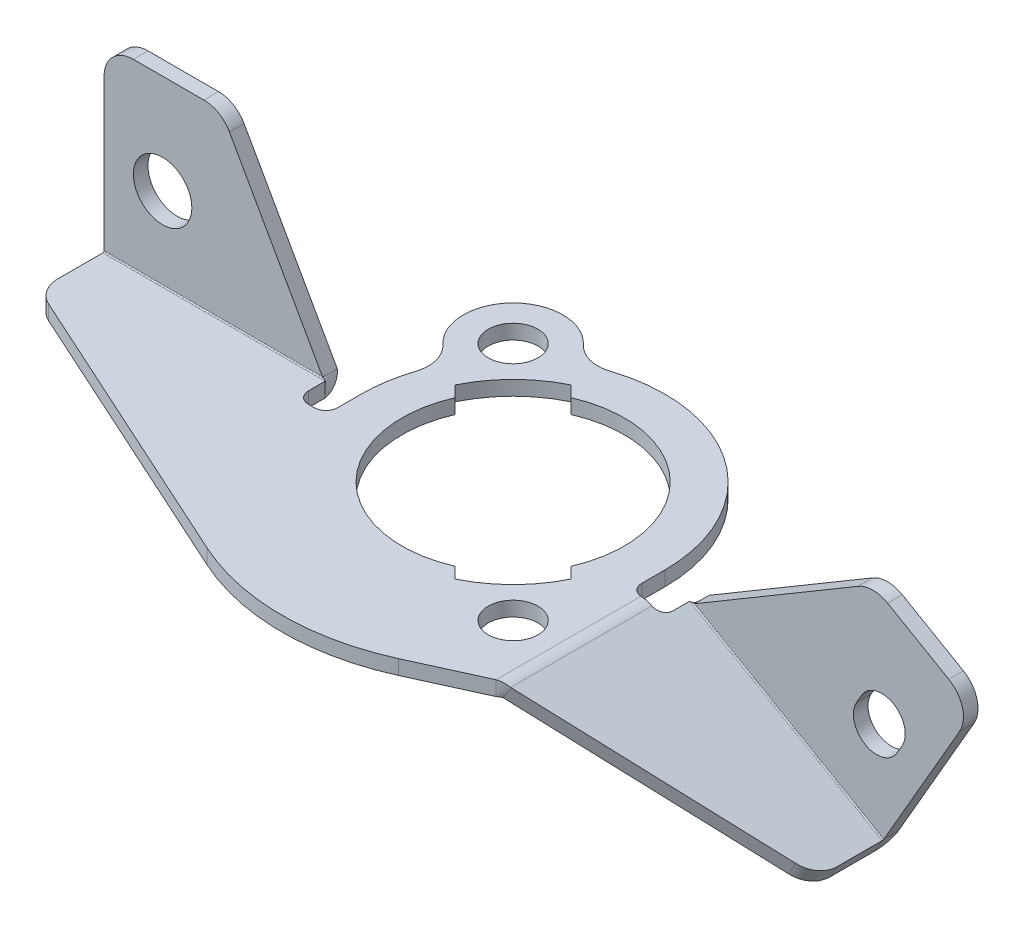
ISO-10303-21;
HEADER;
FILE_DESCRIPTION(('STEP AP214'),'2;1');
FILE_NAME('part.step','',(''),(''),'','','');
FILE_SCHEMA(('AUTOMOTIVE_DESIGN { 1 0 10303 214 1 1 1 1 }'));
ENDSEC;
DATA;
#1=APPLICATION_CONTEXT('core data for automotive mechanical design processes');
#2=APPLICATION_PROTOCOL_DEFINITION('international standard','automotive_design',2000,#1);
#3=PRODUCT_CONTEXT('',#1,'mechanical');
#4=PRODUCT('Part','Part','',(#3));
#5=PRODUCT_RELATED_PRODUCT_CATEGORY('part','',(#4));
#6=PRODUCT_DEFINITION_FORMATION('','',#4);
#7=PRODUCT_DEFINITION_CONTEXT('part definition',#1,'design');
#8=PRODUCT_DEFINITION('design','',#6,#7);
#9=PRODUCT_DEFINITION_SHAPE('','',#8);
#10=(LENGTH_UNIT() NAMED_UNIT(*) SI_UNIT(.MILLI.,.METRE.));
#11=(NAMED_UNIT(*) PLANE_ANGLE_UNIT() SI_UNIT($,.RADIAN.));
#12=(NAMED_UNIT(*) SI_UNIT($,.STERADIAN.) SOLID_ANGLE_UNIT());
#13=UNCERTAINTY_MEASURE_WITH_UNIT(LENGTH_MEASURE(1.E-05),#10,'distance_accuracy_value','');
#14=(GEOMETRIC_REPRESENTATION_CONTEXT(3) GLOBAL_UNCERTAINTY_ASSIGNED_CONTEXT((#13)) GLOBAL_UNIT_ASSIGNED_CONTEXT((#10,
#11,#12)) REPRESENTATION_CONTEXT('',''));
#15=CARTESIAN_POINT('',(0.,0.,0.));
#16=DIRECTION('',(0.,0.,1.));
#17=DIRECTION('',(1.,0.,0.));
#18=AXIS2_PLACEMENT_3D('',#15,#16,#17);
#19=CARTESIAN_POINT('',(215.77848083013,248.853236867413,13.6603641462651));
#20=DIRECTION('',(0.358428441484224,-0.206938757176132,0.910332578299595));
#21=DIRECTION('',(0.788371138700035,-0.4551662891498,-0.413877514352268));
#22=AXIS2_PLACEMENT_3D('',#19,#20,#21);
#23=PLANE('',#22);
#24=DIRECTION('',(-0.788371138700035,0.455166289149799,0.413877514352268));
#25=VECTOR('',#24,1.);
#26=CARTESIAN_POINT('',(61.6963500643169,-18.0248421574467,13.660364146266));
#27=LINE('',#26,#25);
#28=CARTESIAN_POINT('',(61.6963500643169,-18.0248421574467,13.660364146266));
#29=VERTEX_POINT('',#28);
#30=CARTESIAN_POINT('',(29.7205015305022,0.436422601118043,30.4469815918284));
#31=VERTEX_POINT('',#30);
#32=EDGE_CURVE('E875',#29,#31,#27,.T.);
#33=ORIENTED_EDGE('',*,*,#32,.T.);
#34=CARTESIAN_POINT('',(28.4705015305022,-1.72864090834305,30.4469815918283));
#35=CARTESIAN_POINT('',(29.7205015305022,0.436422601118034,30.4469815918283));
#36=B_SPLINE_CURVE_WITH_KNOTS('',1,(#34,#35),.UNSPECIFIED.,.F.,.F.,(2,2),(0.,1.),.UNSPECIFIED.);
#37=CARTESIAN_POINT('',(29.0951520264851,-0.646714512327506,30.4469815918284));
#38=VERTEX_POINT('',#37);
#39=EDGE_CURVE('E42',#31,#38,#36,.F.);
#40=ORIENTED_EDGE('',*,*,#39,.T.);
#41=CARTESIAN_POINT('',(28.4705015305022,-1.72864090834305,30.4469815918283));
#42=CARTESIAN_POINT('',(29.7205015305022,0.436422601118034,30.4469815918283));
#43=B_SPLINE_CURVE_WITH_KNOTS('',1,(#41,#42),.UNSPECIFIED.,.F.,.F.,(2,2),(0.,1.),.UNSPECIFIED.);
#44=CARTESIAN_POINT('',(28.4705015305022,-1.72864090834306,30.4469815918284));
#45=VERTEX_POINT('',#44);
#46=EDGE_CURVE('E419',#38,#45,#43,.F.);
#47=ORIENTED_EDGE('',*,*,#46,.T.);
#48=DIRECTION('',(-0.788371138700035,0.455166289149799,0.413877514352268));
#49=VECTOR('',#48,1.);
#50=CARTESIAN_POINT('',(60.4463500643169,-20.1899056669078,13.660364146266));
#51=LINE('',#50,#49);
#52=CARTESIAN_POINT('',(60.4463500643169,-20.1899056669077,13.660364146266));
#53=VERTEX_POINT('',#52);
#54=EDGE_CURVE('E901',#53,#45,#51,.T.);
#55=ORIENTED_EDGE('',*,*,#54,.F.);
#56=DIRECTION('',(-0.500000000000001,-0.866025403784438,0.));
#57=VECTOR('',#56,1.);
#58=CARTESIAN_POINT('',(215.77848083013,248.853236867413,13.6603641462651));
#59=LINE('',#58,#57);
#60=EDGE_CURVE('E861',#29,#53,#59,.T.);
#61=ORIENTED_EDGE('',*,*,#60,.F.);
#62=EDGE_LOOP('',(#33,#40,#47,#55,#61));
#63=FACE_BOUND('',#62,.T.);
#64=ADVANCED_FACE('F31',(#63),#23,.T.);
#65=CARTESIAN_POINT('',(4.47196522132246,15.0136718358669,0.31117266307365));
#66=DIRECTION('',(0.500000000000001,0.866025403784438,0.));
#67=DIRECTION('',(0.866025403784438,-0.500000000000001,0.));
#68=AXIS2_PLACEMENT_3D('',#65,#66,#67);
#69=PLANE('',#68);
#70=CARTESIAN_POINT('',(29.5867019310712,0.513671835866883,4.31117266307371));
#71=DIRECTION('',(-0.500000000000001,-0.866025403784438,0.));
#72=DIRECTION('',(-0.866025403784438,0.500000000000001,0.));
#73=AXIS2_PLACEMENT_3D('',#70,#71,#72);
#74=CIRCLE('',#73,2.);
#75=CARTESIAN_POINT('',(31.3187527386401,-0.48632816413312,4.31117266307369));
#76=VERTEX_POINT('',#75);
#77=CARTESIAN_POINT('',(29.7205015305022,0.436422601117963,6.30519628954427));
#78=VERTEX_POINT('',#77);
#79=EDGE_CURVE('E869',#76,#78,#74,.T.);
#80=ORIENTED_EDGE('',*,*,#79,.T.);
#81=DIRECTION('',(0.,0.,1.));
#82=VECTOR('',#81,1.);
#83=CARTESIAN_POINT('',(29.7205015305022,0.436422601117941,0.311172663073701));
#84=LINE('',#83,#82);
#85=EDGE_CURVE('E858',#78,#31,#84,.T.);
#86=ORIENTED_EDGE('',*,*,#85,.T.);
#87=ORIENTED_EDGE('',*,*,#32,.F.);
#88=CARTESIAN_POINT('',(59.9042078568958,-16.990148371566,9.10870125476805));
#89=DIRECTION('',(-0.500000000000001,-0.866025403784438,0.));
#90=DIRECTION('',(-0.866025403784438,0.500000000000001,0.));
#91=AXIS2_PLACEMENT_3D('',#88,#89,#90);
#92=CIRCLE('',#91,5.);
#93=CARTESIAN_POINT('',(64.234334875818,-19.490148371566,9.10870125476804));
#94=VERTEX_POINT('',#93);
#95=EDGE_CURVE('E877',#94,#29,#92,.T.);
#96=ORIENTED_EDGE('',*,*,#95,.F.);
#97=DIRECTION('',(0.,0.,-1.));
#98=VECTOR('',#97,1.);
#99=CARTESIAN_POINT('',(64.234334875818,-19.490148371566,9.10870125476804));
#100=LINE('',#99,#98);
#101=CARTESIAN_POINT('',(64.234334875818,-19.490148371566,1.45000000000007));
#102=VERTEX_POINT('',#101);
#103=EDGE_CURVE('E1017',#94,#102,#100,.T.);
#104=ORIENTED_EDGE('',*,*,#103,.T.);
#105=DIRECTION('',(0.866025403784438,-0.500000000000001,0.));
#106=VECTOR('',#105,1.);
#107=CARTESIAN_POINT('',(4.47196522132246,15.0136718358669,1.44999999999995));
#108=LINE('',#107,#106);
#109=CARTESIAN_POINT('',(31.3187527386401,-0.486328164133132,1.45000000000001));
#110=VERTEX_POINT('',#109);
#111=EDGE_CURVE('E1019',#110,#102,#108,.T.);
#112=ORIENTED_EDGE('',*,*,#111,.F.);
#113=DIRECTION('',(0.,0.,1.));
#114=VECTOR('',#113,1.);
#115=CARTESIAN_POINT('',(31.3187527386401,-0.486328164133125,0.311172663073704));
#116=LINE('',#115,#114);
#117=EDGE_CURVE('E872',#110,#76,#116,.T.);
#118=ORIENTED_EDGE('',*,*,#117,.T.);
#119=EDGE_LOOP('',(#80,#86,#87,#96,#104,#112,#118));
#120=FACE_BOUND('',#119,.T.);
#121=ADVANCED_FACE('F1000',(#120),#69,.T.);
#122=CARTESIAN_POINT('',(3.22196522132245,12.8486083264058,0.311172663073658));
#123=DIRECTION('',(0.500000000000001,0.866025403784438,0.));
#124=DIRECTION('',(0.866025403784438,-0.500000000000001,0.));
#125=AXIS2_PLACEMENT_3D('',#122,#123,#124);
#126=PLANE('',#125);
#127=DIRECTION('',(0.,0.,1.));
#128=VECTOR('',#127,1.);
#129=CARTESIAN_POINT('',(28.4705015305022,-1.72864090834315,0.311172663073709));
#130=LINE('',#129,#128);
#131=CARTESIAN_POINT('',(28.4705015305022,-1.72864090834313,6.30519628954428));
#132=VERTEX_POINT('',#131);
#133=EDGE_CURVE('E425',#132,#45,#130,.T.);
#134=ORIENTED_EDGE('',*,*,#133,.F.);
#135=CARTESIAN_POINT('',(28.3367019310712,-1.65139167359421,4.31117266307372));
#136=DIRECTION('',(-0.500000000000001,-0.866025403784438,0.));
#137=DIRECTION('',(-0.866025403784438,0.500000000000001,0.));
#138=AXIS2_PLACEMENT_3D('',#135,#136,#137);
#139=CIRCLE('',#138,2.);
#140=CARTESIAN_POINT('',(30.0687527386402,-2.65139167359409,4.3111726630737));
#141=VERTEX_POINT('',#140);
#142=EDGE_CURVE('E871',#141,#132,#139,.T.);
#143=ORIENTED_EDGE('',*,*,#142,.F.);
#144=DIRECTION('',(0.,0.,1.));
#145=VECTOR('',#144,1.);
#146=CARTESIAN_POINT('',(30.0687527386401,-2.65139167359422,0.311172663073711));
#147=LINE('',#146,#145);
#148=CARTESIAN_POINT('',(30.0687527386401,-2.6513916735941,1.45000000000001));
#149=VERTEX_POINT('',#148);
#150=EDGE_CURVE('E909',#149,#141,#147,.T.);
#151=ORIENTED_EDGE('',*,*,#150,.F.);
#152=DIRECTION('',(0.866025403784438,-0.500000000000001,0.));
#153=VECTOR('',#152,1.);
#154=CARTESIAN_POINT('',(3.22196522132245,12.8486083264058,1.44999999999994));
#155=LINE('',#154,#153);
#156=CARTESIAN_POINT('',(62.984334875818,-21.6552118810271,1.45000000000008));
#157=VERTEX_POINT('',#156);
#158=EDGE_CURVE('E1030',#149,#157,#155,.T.);
#159=ORIENTED_EDGE('',*,*,#158,.T.);
#160=DIRECTION('',(0.,0.,-1.));
#161=VECTOR('',#160,1.);
#162=CARTESIAN_POINT('',(62.984334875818,-21.6552118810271,9.10870125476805));
#163=LINE('',#162,#161);
#164=CARTESIAN_POINT('',(62.984334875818,-21.655211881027,9.10870125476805));
#165=VERTEX_POINT('',#164);
#166=EDGE_CURVE('E1027',#165,#157,#163,.T.);
#167=ORIENTED_EDGE('',*,*,#166,.F.);
#168=CARTESIAN_POINT('',(58.6542078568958,-19.1552118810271,9.10870125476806));
#169=DIRECTION('',(-0.500000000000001,-0.866025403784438,0.));
#170=DIRECTION('',(-0.866025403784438,0.500000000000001,0.));
#171=AXIS2_PLACEMENT_3D('',#168,#169,#170);
#172=CIRCLE('',#171,5.);
#173=EDGE_CURVE('E904',#165,#53,#172,.T.);
#174=ORIENTED_EDGE('',*,*,#173,.T.);
#175=ORIENTED_EDGE('',*,*,#54,.T.);
#176=EDGE_LOOP('',(#134,#143,#151,#159,#167,#174,#175));
#177=FACE_BOUND('',#176,.T.);
#178=ADVANCED_FACE('F1004',(#177),#126,.F.);
#179=CARTESIAN_POINT('',(213.986338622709,249.887930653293,9.10870125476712));
#180=DIRECTION('',(-0.500000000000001,-0.866025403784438,0.));
#181=DIRECTION('',(-0.866025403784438,0.500000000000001,0.));
#182=AXIS2_PLACEMENT_3D('',#179,#180,#181);
#183=CYLINDRICAL_SURFACE('',#182,5.);
#184=ORIENTED_EDGE('',*,*,#173,.F.);
#185=DIRECTION('',(-0.500000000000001,-0.866025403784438,0.));
#186=VECTOR('',#185,1.);
#187=CARTESIAN_POINT('',(218.316465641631,247.387930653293,9.10870125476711));
#188=LINE('',#187,#186);
#189=EDGE_CURVE('E1016',#94,#165,#188,.T.);
#190=ORIENTED_EDGE('',*,*,#189,.F.);
#191=ORIENTED_EDGE('',*,*,#95,.T.);
#192=ORIENTED_EDGE('',*,*,#60,.T.);
#193=EDGE_LOOP('',(#184,#190,#191,#192));
#194=FACE_BOUND('',#193,.T.);
#195=ADVANCED_FACE('F1013',(#194),#183,.T.);
#196=CARTESIAN_POINT('',(218.316465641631,247.387930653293,9.10870125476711));
#197=DIRECTION('',(-0.866025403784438,0.500000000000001,0.));
#198=DIRECTION('',(0.500000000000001,0.866025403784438,0.));
#199=AXIS2_PLACEMENT_3D('',#196,#197,#198);
#200=PLANE('',#199);
#201=ORIENTED_EDGE('',*,*,#189,.T.);
#202=ORIENTED_EDGE('',*,*,#166,.T.);
#203=DIRECTION('',(-0.500000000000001,-0.866025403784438,0.));
#204=VECTOR('',#203,1.);
#205=CARTESIAN_POINT('',(218.316465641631,247.387930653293,1.44999999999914));
#206=LINE('',#205,#204);
#207=EDGE_CURVE('E1034',#102,#157,#206,.T.);
#208=ORIENTED_EDGE('',*,*,#207,.F.);
#209=ORIENTED_EDGE('',*,*,#103,.F.);
#210=EDGE_LOOP('',(#201,#202,#208,#209));
#211=FACE_BOUND('',#210,.T.);
#212=ADVANCED_FACE('F1064',(#211),#200,.F.);
#213=CARTESIAN_POINT('',(185.400883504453,266.391750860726,0.311172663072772));
#214=DIRECTION('',(0.866025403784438,-0.500000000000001,0.));
#215=DIRECTION('',(0.,0.,-1.));
#216=AXIS2_PLACEMENT_3D('',#213,#214,#215);
#217=PLANE('',#216);
#218=CARTESIAN_POINT('',(30.0687527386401,-2.65139167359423,1.45000000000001));
#219=CARTESIAN_POINT('',(31.3187527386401,-0.486328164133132,1.45000000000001));
#220=B_SPLINE_CURVE_WITH_KNOTS('',1,(#218,#219),.UNSPECIFIED.,.F.,.F.,(2,2),(0.,1.),.UNSPECIFIED.);
#221=EDGE_CURVE('E1033',#110,#149,#220,.F.);
#222=ORIENTED_EDGE('',*,*,#221,.T.);
#223=ORIENTED_EDGE('',*,*,#150,.T.);
#224=DIRECTION('',(-0.500000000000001,-0.866025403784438,0.));
#225=VECTOR('',#224,1.);
#226=CARTESIAN_POINT('',(185.400883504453,266.391750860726,4.31117266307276));
#227=LINE('',#226,#225);
#228=EDGE_CURVE('E903',#76,#141,#227,.T.);
#229=ORIENTED_EDGE('',*,*,#228,.F.);
#230=ORIENTED_EDGE('',*,*,#117,.F.);
#231=EDGE_LOOP('',(#222,#223,#229,#230));
#232=FACE_BOUND('',#231,.T.);
#233=ADVANCED_FACE('F1055',(#232),#217,.F.);
#234=CARTESIAN_POINT('',(183.668832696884,267.391750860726,4.31117266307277));
#235=DIRECTION('',(-0.500000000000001,-0.866025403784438,0.));
#236=DIRECTION('',(-0.866025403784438,0.500000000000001,0.));
#237=AXIS2_PLACEMENT_3D('',#234,#235,#236);
#238=CYLINDRICAL_SURFACE('',#237,2.);
#239=CARTESIAN_POINT('',(29.7205015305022,0.436422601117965,6.30519628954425));
#240=CARTESIAN_POINT('',(28.4705015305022,-1.72864090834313,6.30519628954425));
#241=B_SPLINE_CURVE_WITH_KNOTS('',1,(#239,#240),.UNSPECIFIED.,.F.,.F.,(2,2),(0.,1.),.UNSPECIFIED.);
#242=CARTESIAN_POINT('',(29.0858115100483,-0.662892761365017,6.30519628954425));
#243=VERTEX_POINT('',#242);
#244=EDGE_CURVE('E11',#78,#243,#241,.T.);
#245=ORIENTED_EDGE('',*,*,#244,.F.);
#246=ORIENTED_EDGE('',*,*,#79,.F.);
#247=ORIENTED_EDGE('',*,*,#228,.T.);
#248=ORIENTED_EDGE('',*,*,#142,.T.);
#249=CARTESIAN_POINT('',(29.7205015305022,0.436422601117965,6.30519628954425));
#250=CARTESIAN_POINT('',(28.4705015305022,-1.72864090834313,6.30519628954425));
#251=B_SPLINE_CURVE_WITH_KNOTS('',1,(#249,#250),.UNSPECIFIED.,.F.,.F.,(2,2),(0.,1.),.UNSPECIFIED.);
#252=EDGE_CURVE('E843',#243,#132,#251,.T.);
#253=ORIENTED_EDGE('',*,*,#252,.F.);
#254=EDGE_LOOP('',(#245,#246,#247,#248,#253));
#255=FACE_BOUND('',#254,.T.);
#256=ADVANCED_FACE('F911',(#255),#238,.F.);
#257=CARTESIAN_POINT('',(4.00255155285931,14.2006235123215,-1.25000000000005));
#258=DIRECTION('',(0.,0.,1.));
#259=DIRECTION('',(0.866025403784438,-0.500000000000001,0.));
#260=AXIS2_PLACEMENT_3D('',#257,#258,#259);
#261=PLANE('',#260);
#262=DIRECTION('',(0.866025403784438,-0.500000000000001,0.));
#263=VECTOR('',#262,1.);
#264=CARTESIAN_POINT('',(4.57196522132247,15.1868769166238,-1.25000000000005));
#265=LINE('',#264,#263);
#266=CARTESIAN_POINT('',(31.9735202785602,-0.633418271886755,-1.24999999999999));
#267=VERTEX_POINT('',#266);
#268=CARTESIAN_POINT('',(64.334334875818,-19.3169432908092,-1.24999999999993));
#269=VERTEX_POINT('',#268);
#270=EDGE_CURVE('E1240',#267,#269,#265,.T.);
#271=ORIENTED_EDGE('',*,*,#270,.F.);
#272=DIRECTION('',(-0.860366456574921,-0.509675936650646,0.));
#273=VECTOR('',#272,1.);
#274=CARTESIAN_POINT('',(59.9218805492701,15.9230229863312,-1.24999999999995));
#275=LINE('',#274,#273);
#276=CARTESIAN_POINT('',(59.9218805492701,15.9230229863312,-1.24999999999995));
#277=VERTEX_POINT('',#276);
#278=EDGE_CURVE('E1119',#277,#267,#275,.T.);
#279=ORIENTED_EDGE('',*,*,#278,.F.);
#280=CARTESIAN_POINT('',(62.4702602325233,11.6211907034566,-1.24999999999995));
#281=DIRECTION('',(0.,0.,-1.));
#282=DIRECTION('',(-0.866025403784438,0.500000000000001,0.));
#283=AXIS2_PLACEMENT_3D('',#280,#281,#282);
#284=CIRCLE('',#283,5.);
#285=CARTESIAN_POINT('',(64.9702602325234,15.9513177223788,-1.24999999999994));
#286=VERTEX_POINT('',#285);
#287=EDGE_CURVE('E1245',#277,#286,#284,.T.);
#288=ORIENTED_EDGE('',*,*,#287,.T.);
#289=DIRECTION('',(-0.866025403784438,0.500000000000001,0.));
#290=VECTOR('',#289,1.);
#291=CARTESIAN_POINT('',(75.4347941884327,9.90961622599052,-1.24999999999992));
#292=LINE('',#291,#290);
#293=CARTESIAN_POINT('',(75.4347941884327,9.90961622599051,-1.24999999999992));
#294=VERTEX_POINT('',#293);
#295=EDGE_CURVE('E1250',#294,#286,#292,.T.);
#296=ORIENTED_EDGE('',*,*,#295,.F.);
#297=CARTESIAN_POINT('',(72.9347941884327,5.57948920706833,-1.24999999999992));
#298=DIRECTION('',(0.,0.,-1.));
#299=DIRECTION('',(-0.866025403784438,0.500000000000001,0.));
#300=AXIS2_PLACEMENT_3D('',#297,#298,#299);
#301=CIRCLE('',#300,5.);
#302=CARTESIAN_POINT('',(77.2649212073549,3.07948920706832,-1.24999999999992));
#303=VERTEX_POINT('',#302);
#304=EDGE_CURVE('E1253',#294,#303,#301,.T.);
#305=ORIENTED_EDGE('',*,*,#304,.T.);
#306=DIRECTION('',(0.500000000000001,0.866025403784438,0.));
#307=VECTOR('',#306,1.);
#308=CARTESIAN_POINT('',(59.3661569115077,-27.9220799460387,-1.24999999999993));
#309=LINE('',#308,#307);
#310=EDGE_CURVE('E1256',#269,#303,#309,.T.);
#311=ORIENTED_EDGE('',*,*,#310,.F.);
#312=EDGE_LOOP('',(#271,#279,#288,#296,#305,#311));
#313=FACE_BOUND('',#312,.T.);
#314=CARTESIAN_POINT('',(63.1227407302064,-3.41548590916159,-1.24999999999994));
#315=DIRECTION('',(0.,0.,1.));
#316=DIRECTION('',(0.866025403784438,-0.500000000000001,0.));
#317=AXIS2_PLACEMENT_3D('',#314,#315,#316);
#318=CIRCLE('',#317,3.99999988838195);
#319=CARTESIAN_POINT('',(59.6586391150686,-1.41548590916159,-1.24999999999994));
#320=VERTEX_POINT('',#319);
#321=CARTESIAN_POINT('',(66.5875101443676,-5.41432835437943,-1.24999999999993));
#322=VERTEX_POINT('',#321);
#323=EDGE_CURVE('E1237',#320,#322,#318,.T.);
#324=ORIENTED_EDGE('',*,*,#323,.T.);
#325=DIRECTION('',(-0.499710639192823,-0.866192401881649,0.));
#326=VECTOR('',#325,1.);
#327=CARTESIAN_POINT('',(67.4168153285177,-3.9768207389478,-1.24999999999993));
#328=LINE('',#327,#326);
#329=CARTESIAN_POINT('',(67.4168153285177,-3.9768207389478,-1.24999999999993));
#330=VERTEX_POINT('',#329);
#331=EDGE_CURVE('E1222',#330,#322,#328,.T.);
#332=ORIENTED_EDGE('',*,*,#331,.F.);
#333=CARTESIAN_POINT('',(63.986506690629,-1.91939937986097,-1.24999999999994));
#334=DIRECTION('',(0.,0.,1.));
#335=DIRECTION('',(0.866025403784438,-0.500000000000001,0.));
#336=AXIS2_PLACEMENT_3D('',#333,#334,#335);
#337=CIRCLE('',#336,4.00000000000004);
#338=CARTESIAN_POINT('',(60.5224050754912,0.0806006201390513,-1.24999999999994));
#339=VERTEX_POINT('',#338);
#340=EDGE_CURVE('E1229',#330,#339,#337,.T.);
#341=ORIENTED_EDGE('',*,*,#340,.T.);
#342=DIRECTION('',(-0.499999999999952,-0.866025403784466,0.));
#343=VECTOR('',#342,1.);
#344=CARTESIAN_POINT('',(60.5224050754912,0.0806006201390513,-1.24999999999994));
#345=LINE('',#344,#343);
#346=EDGE_CURVE('E1234',#339,#320,#345,.T.);
#347=ORIENTED_EDGE('',*,*,#346,.T.);
#348=EDGE_LOOP('',(#324,#332,#341,#347));
#349=FACE_BOUND('',#348,.T.);
#350=ADVANCED_FACE('F1099',(#313,#349),#261,.F.);
#351=CARTESIAN_POINT('',(63.1227407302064,-3.41548590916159,1.25000000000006));
#352=DIRECTION('',(0.,0.,-1.));
#353=DIRECTION('',(-0.866025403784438,0.500000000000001,0.));
#354=AXIS2_PLACEMENT_3D('',#351,#352,#353);
#355=CYLINDRICAL_SURFACE('',#354,3.99999988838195);
#356=DIRECTION('',(0.,0.,-1.));
#357=VECTOR('',#356,1.);
#358=CARTESIAN_POINT('',(66.5875101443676,-5.41432835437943,1.25000000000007));
#359=LINE('',#358,#357);
#360=CARTESIAN_POINT('',(66.5875101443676,-5.41432835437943,1.25000000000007));
#361=VERTEX_POINT('',#360);
#362=EDGE_CURVE('E1224',#361,#322,#359,.T.);
#363=ORIENTED_EDGE('',*,*,#362,.T.);
#364=ORIENTED_EDGE('',*,*,#323,.F.);
#365=DIRECTION('',(0.,0.,-1.));
#366=VECTOR('',#365,1.);
#367=CARTESIAN_POINT('',(59.6586391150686,-1.41548590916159,1.25000000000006));
#368=LINE('',#367,#366);
#369=CARTESIAN_POINT('',(59.6586391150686,-1.41548590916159,1.25000000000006));
#370=VERTEX_POINT('',#369);
#371=EDGE_CURVE('E1232',#370,#320,#368,.T.);
#372=ORIENTED_EDGE('',*,*,#371,.F.);
#373=CARTESIAN_POINT('',(63.1227407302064,-3.41548590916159,1.25000000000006));
#374=DIRECTION('',(0.,0.,1.));
#375=DIRECTION('',(0.866025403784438,-0.500000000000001,0.));
#376=AXIS2_PLACEMENT_3D('',#373,#374,#375);
#377=CIRCLE('',#376,3.99999988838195);
#378=EDGE_CURVE('E1126',#370,#361,#377,.T.);
#379=ORIENTED_EDGE('',*,*,#378,.T.);
#380=EDGE_LOOP('',(#363,#364,#372,#379));
#381=FACE_BOUND('',#380,.T.);
#382=ADVANCED_FACE('F1994',(#381),#355,.F.);
#383=CARTESIAN_POINT('',(60.5224050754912,0.0806006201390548,1.25000000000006));
#384=DIRECTION('',(0.866025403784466,-0.499999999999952,0.));
#385=DIRECTION('',(0.499999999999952,0.866025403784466,0.));
#386=AXIS2_PLACEMENT_3D('',#383,#384,#385);
#387=PLANE('',#386);
#388=DIRECTION('',(-0.499999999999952,-0.866025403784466,0.));
#389=VECTOR('',#388,1.);
#390=CARTESIAN_POINT('',(60.5224050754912,0.0806006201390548,1.25000000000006));
#391=LINE('',#390,#389);
#392=CARTESIAN_POINT('',(60.5224050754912,0.0806006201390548,1.25000000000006));
#393=VERTEX_POINT('',#392);
#394=EDGE_CURVE('E1194',#393,#370,#391,.T.);
#395=ORIENTED_EDGE('',*,*,#394,.T.);
#396=ORIENTED_EDGE('',*,*,#371,.T.);
#397=ORIENTED_EDGE('',*,*,#346,.F.);
#398=DIRECTION('',(0.,0.,-1.));
#399=VECTOR('',#398,1.);
#400=CARTESIAN_POINT('',(60.5224050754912,0.0806006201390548,1.25000000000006));
#401=LINE('',#400,#399);
#402=EDGE_CURVE('E1227',#393,#339,#401,.T.);
#403=ORIENTED_EDGE('',*,*,#402,.F.);
#404=EDGE_LOOP('',(#395,#396,#397,#403));
#405=FACE_BOUND('',#404,.T.);
#406=ADVANCED_FACE('F1985',(#405),#387,.T.);
#407=CARTESIAN_POINT('',(63.986506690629,-1.91939937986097,1.25000000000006));
#408=DIRECTION('',(0.,0.,-1.));
#409=DIRECTION('',(-0.866025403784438,0.500000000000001,0.));
#410=AXIS2_PLACEMENT_3D('',#407,#408,#409);
#411=CYLINDRICAL_SURFACE('',#410,4.00000000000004);
#412=ORIENTED_EDGE('',*,*,#402,.T.);
#413=ORIENTED_EDGE('',*,*,#340,.F.);
#414=DIRECTION('',(0.,0.,-1.));
#415=VECTOR('',#414,1.);
#416=CARTESIAN_POINT('',(67.4168153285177,-3.97682073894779,1.25000000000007));
#417=LINE('',#416,#415);
#418=CARTESIAN_POINT('',(67.4168153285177,-3.97682073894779,1.25000000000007));
#419=VERTEX_POINT('',#418);
#420=EDGE_CURVE('E1220',#419,#330,#417,.T.);
#421=ORIENTED_EDGE('',*,*,#420,.F.);
#422=CARTESIAN_POINT('',(63.986506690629,-1.91939937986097,1.25000000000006));
#423=DIRECTION('',(0.,0.,1.));
#424=DIRECTION('',(0.866025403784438,-0.500000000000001,0.));
#425=AXIS2_PLACEMENT_3D('',#422,#423,#424);
#426=CIRCLE('',#425,4.00000000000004);
#427=EDGE_CURVE('E1197',#419,#393,#426,.T.);
#428=ORIENTED_EDGE('',*,*,#427,.T.);
#429=EDGE_LOOP('',(#412,#413,#421,#428));
#430=FACE_BOUND('',#429,.T.);
#431=ADVANCED_FACE('F1977',(#430),#411,.F.);
#432=CARTESIAN_POINT('',(67.4168153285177,-3.97682073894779,1.25000000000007));
#433=DIRECTION('',(0.866192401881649,-0.499710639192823,0.));
#434=DIRECTION('',(0.499710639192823,0.866192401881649,0.));
#435=AXIS2_PLACEMENT_3D('',#432,#433,#434);
#436=PLANE('',#435);
#437=ORIENTED_EDGE('',*,*,#420,.T.);
#438=ORIENTED_EDGE('',*,*,#331,.T.);
#439=ORIENTED_EDGE('',*,*,#362,.F.);
#440=DIRECTION('',(-0.499710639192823,-0.866192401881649,0.));
#441=VECTOR('',#440,1.);
#442=CARTESIAN_POINT('',(67.4168153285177,-3.97682073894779,1.25000000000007));
#443=LINE('',#442,#441);
#444=EDGE_CURVE('E1124',#419,#361,#443,.T.);
#445=ORIENTED_EDGE('',*,*,#444,.F.);
#446=EDGE_LOOP('',(#437,#438,#439,#445));
#447=FACE_BOUND('',#446,.T.);
#448=ADVANCED_FACE('F1969',(#447),#436,.F.);
#449=CARTESIAN_POINT('',(4.0025515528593,14.2006235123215,1.24999999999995));
#450=DIRECTION('',(0.,0.,1.));
#451=DIRECTION('',(0.866025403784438,-0.500000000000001,0.));
#452=AXIS2_PLACEMENT_3D('',#449,#450,#451);
#453=PLANE('',#452);
#454=ORIENTED_EDGE('',*,*,#444,.T.);
#455=ORIENTED_EDGE('',*,*,#378,.F.);
#456=ORIENTED_EDGE('',*,*,#394,.F.);
#457=ORIENTED_EDGE('',*,*,#427,.F.);
#458=EDGE_LOOP('',(#454,#455,#456,#457));
#459=FACE_BOUND('',#458,.T.);
#460=DIRECTION('',(-0.860366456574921,-0.509675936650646,0.));
#461=VECTOR('',#460,1.);
#462=CARTESIAN_POINT('',(59.9218805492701,15.9230229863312,1.25000000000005));
#463=LINE('',#462,#461);
#464=CARTESIAN_POINT('',(59.9218805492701,15.9230229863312,1.25000000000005));
#465=VERTEX_POINT('',#464);
#466=CARTESIAN_POINT('',(31.9735202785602,-0.633418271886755,1.25000000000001));
#467=VERTEX_POINT('',#466);
#468=EDGE_CURVE('E1200',#465,#467,#463,.T.);
#469=ORIENTED_EDGE('',*,*,#468,.T.);
#470=DIRECTION('',(0.866025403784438,-0.500000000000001,0.));
#471=VECTOR('',#470,1.);
#472=CARTESIAN_POINT('',(4.57196522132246,15.1868769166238,1.24999999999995));
#473=LINE('',#472,#471);
#474=CARTESIAN_POINT('',(64.3343348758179,-19.3169432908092,1.25000000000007));
#475=VERTEX_POINT('',#474);
#476=EDGE_CURVE('E1203',#467,#475,#473,.T.);
#477=ORIENTED_EDGE('',*,*,#476,.T.);
#478=DIRECTION('',(0.500000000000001,0.866025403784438,0.));
#479=VECTOR('',#478,1.);
#480=CARTESIAN_POINT('',(59.3661569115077,-27.9220799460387,1.25000000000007));
#481=LINE('',#480,#479);
#482=CARTESIAN_POINT('',(77.2649212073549,3.07948920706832,1.25000000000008));
#483=VERTEX_POINT('',#482);
#484=EDGE_CURVE('E1208',#475,#483,#481,.T.);
#485=ORIENTED_EDGE('',*,*,#484,.T.);
#486=CARTESIAN_POINT('',(72.9347941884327,5.57948920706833,1.25000000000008));
#487=DIRECTION('',(0.,0.,-1.));
#488=DIRECTION('',(-0.866025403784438,0.500000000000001,0.));
#489=AXIS2_PLACEMENT_3D('',#486,#487,#488);
#490=CIRCLE('',#489,5.);
#491=CARTESIAN_POINT('',(75.4347941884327,9.90961622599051,1.25000000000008));
#492=VERTEX_POINT('',#491);
#493=EDGE_CURVE('E1212',#492,#483,#490,.T.);
#494=ORIENTED_EDGE('',*,*,#493,.F.);
#495=DIRECTION('',(-0.866025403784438,0.500000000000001,0.));
#496=VECTOR('',#495,1.);
#497=CARTESIAN_POINT('',(75.4347941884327,9.90961622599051,1.25000000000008));
#498=LINE('',#497,#496);
#499=CARTESIAN_POINT('',(64.9702602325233,15.9513177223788,1.25000000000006));
#500=VERTEX_POINT('',#499);
#501=EDGE_CURVE('E1215',#492,#500,#498,.T.);
#502=ORIENTED_EDGE('',*,*,#501,.T.);
#503=CARTESIAN_POINT('',(62.4702602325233,11.6211907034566,1.25000000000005));
#504=DIRECTION('',(0.,0.,-1.));
#505=DIRECTION('',(-0.866025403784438,0.500000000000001,0.));
#506=AXIS2_PLACEMENT_3D('',#503,#504,#505);
#507=CIRCLE('',#506,5.);
#508=EDGE_CURVE('E1217',#465,#500,#507,.T.);
#509=ORIENTED_EDGE('',*,*,#508,.F.);
#510=EDGE_LOOP('',(#469,#477,#485,#494,#502,#509));
#511=FACE_BOUND('',#510,.T.);
#512=ADVANCED_FACE('F1097',(#459,#511),#453,.T.);
#513=CARTESIAN_POINT('',(59.9218805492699,15.9230229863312,98.1769499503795));
#514=DIRECTION('',(0.509675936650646,-0.860366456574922,0.));
#515=DIRECTION('',(0.860366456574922,0.509675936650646,0.));
#516=AXIS2_PLACEMENT_3D('',#513,#514,#515);
#517=PLANE('',#516);
#518=DIRECTION('',(0.,0.,-1.));
#519=VECTOR('',#518,1.);
#520=CARTESIAN_POINT('',(59.9218805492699,15.9230229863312,98.1769499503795));
#521=LINE('',#520,#519);
#522=EDGE_CURVE('E1258',#465,#277,#521,.T.);
#523=ORIENTED_EDGE('',*,*,#522,.T.);
#524=ORIENTED_EDGE('',*,*,#278,.T.);
#525=CARTESIAN_POINT('',(31.9735202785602,-0.633418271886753,1.25000000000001));
#526=CARTESIAN_POINT('',(31.9735202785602,-0.633418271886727,-1.24999999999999));
#527=B_SPLINE_CURVE_WITH_KNOTS('',1,(#525,#526),.UNSPECIFIED.,.F.,.F.,(2,2),(0.,1.),.UNSPECIFIED.);
#528=CARTESIAN_POINT('',(31.9735202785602,-0.633418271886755,0.725064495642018));
#529=VERTEX_POINT('',#528);
#530=EDGE_CURVE('E1115',#529,#267,#527,.T.);
#531=ORIENTED_EDGE('',*,*,#530,.F.);
#532=CARTESIAN_POINT('',(31.9735202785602,-0.633418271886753,1.25000000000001));
#533=CARTESIAN_POINT('',(31.9735202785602,-0.633418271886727,-1.24999999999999));
#534=B_SPLINE_CURVE_WITH_KNOTS('',1,(#532,#533),.UNSPECIFIED.,.F.,.F.,(2,2),(0.,1.),.UNSPECIFIED.);
#535=EDGE_CURVE('E878',#467,#529,#534,.T.);
#536=ORIENTED_EDGE('',*,*,#535,.F.);
#537=ORIENTED_EDGE('',*,*,#468,.F.);
#538=EDGE_LOOP('',(#523,#524,#531,#536,#537));
#539=FACE_BOUND('',#538,.T.);
#540=ADVANCED_FACE('F1081',(#539),#517,.F.);
#541=CARTESIAN_POINT('',(59.3661569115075,-27.9220799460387,98.1769499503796));
#542=DIRECTION('',(-0.866025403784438,0.500000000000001,0.));
#543=DIRECTION('',(-0.500000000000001,-0.866025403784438,0.));
#544=AXIS2_PLACEMENT_3D('',#541,#542,#543);
#545=PLANE('',#544);
#546=DIRECTION('',(0.,0.,-1.));
#547=VECTOR('',#546,1.);
#548=CARTESIAN_POINT('',(64.3343348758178,-19.3169432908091,98.1769499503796));
#549=LINE('',#548,#547);
#550=EDGE_CURVE('E1267',#475,#269,#549,.T.);
#551=ORIENTED_EDGE('',*,*,#550,.T.);
#552=ORIENTED_EDGE('',*,*,#310,.T.);
#553=DIRECTION('',(0.,0.,-1.));
#554=VECTOR('',#553,1.);
#555=CARTESIAN_POINT('',(77.2649212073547,3.07948920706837,98.1769499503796));
#556=LINE('',#555,#554);
#557=EDGE_CURVE('E1265',#483,#303,#556,.T.);
#558=ORIENTED_EDGE('',*,*,#557,.F.);
#559=ORIENTED_EDGE('',*,*,#484,.F.);
#560=EDGE_LOOP('',(#551,#552,#558,#559));
#561=FACE_BOUND('',#560,.T.);
#562=ADVANCED_FACE('F1077',(#561),#545,.F.);
#563=CARTESIAN_POINT('',(72.9347941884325,5.57948920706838,98.1769499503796));
#564=DIRECTION('',(0.,0.,-1.));
#565=DIRECTION('',(-0.866025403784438,0.500000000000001,0.));
#566=AXIS2_PLACEMENT_3D('',#563,#564,#565);
#567=CYLINDRICAL_SURFACE('',#566,5.);
#568=ORIENTED_EDGE('',*,*,#304,.F.);
#569=DIRECTION('',(0.,0.,-1.));
#570=VECTOR('',#569,1.);
#571=CARTESIAN_POINT('',(75.4347941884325,9.90961622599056,98.1769499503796));
#572=LINE('',#571,#570);
#573=EDGE_CURVE('E1262',#492,#294,#572,.T.);
#574=ORIENTED_EDGE('',*,*,#573,.F.);
#575=ORIENTED_EDGE('',*,*,#493,.T.);
#576=ORIENTED_EDGE('',*,*,#557,.T.);
#577=EDGE_LOOP('',(#568,#574,#575,#576));
#578=FACE_BOUND('',#577,.T.);
#579=ADVANCED_FACE('F1080',(#578),#567,.T.);
#580=CARTESIAN_POINT('',(75.4347941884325,9.90961622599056,98.1769499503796));
#581=DIRECTION('',(-0.500000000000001,-0.866025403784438,0.));
#582=DIRECTION('',(0.866025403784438,-0.500000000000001,0.));
#583=AXIS2_PLACEMENT_3D('',#580,#581,#582);
#584=PLANE('',#583);
#585=ORIENTED_EDGE('',*,*,#573,.T.);
#586=ORIENTED_EDGE('',*,*,#295,.T.);
#587=DIRECTION('',(0.,0.,-1.));
#588=VECTOR('',#587,1.);
#589=CARTESIAN_POINT('',(64.9702602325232,15.9513177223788,98.1769499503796));
#590=LINE('',#589,#588);
#591=EDGE_CURVE('E1260',#500,#286,#590,.T.);
#592=ORIENTED_EDGE('',*,*,#591,.F.);
#593=ORIENTED_EDGE('',*,*,#501,.F.);
#594=EDGE_LOOP('',(#585,#586,#592,#593));
#595=FACE_BOUND('',#594,.T.);
#596=ADVANCED_FACE('F1085',(#595),#584,.F.);
#597=CARTESIAN_POINT('',(62.4702602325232,11.6211907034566,98.1769499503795));
#598=DIRECTION('',(0.,0.,-1.));
#599=DIRECTION('',(-0.866025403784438,0.500000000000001,0.));
#600=AXIS2_PLACEMENT_3D('',#597,#598,#599);
#601=CYLINDRICAL_SURFACE('',#600,5.);
#602=ORIENTED_EDGE('',*,*,#287,.F.);
#603=ORIENTED_EDGE('',*,*,#522,.F.);
#604=ORIENTED_EDGE('',*,*,#508,.T.);
#605=ORIENTED_EDGE('',*,*,#591,.T.);
#606=EDGE_LOOP('',(#602,#603,#604,#605));
#607=FACE_BOUND('',#606,.T.);
#608=ADVANCED_FACE('F1089',(#607),#601,.T.);
#609=CARTESIAN_POINT('',(64.3343348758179,-19.3169432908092,1.45000000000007));
#610=DIRECTION('',(0.866025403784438,-0.500000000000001,0.));
#611=DIRECTION('',(0.,0.,-1.));
#612=AXIS2_PLACEMENT_3D('',#609,#610,#611);
#613=PLANE('',#612);
#614=ORIENTED_EDGE('',*,*,#550,.F.);
#615=CARTESIAN_POINT('',(64.3343348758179,-19.3169432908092,1.45000000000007));
#616=DIRECTION('',(0.866025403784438,-0.500000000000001,0.));
#617=DIRECTION('',(0.500000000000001,0.866025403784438,0.));
#618=AXIS2_PLACEMENT_3D('',#615,#616,#617);
#619=CIRCLE('',#618,0.2);
#620=EDGE_CURVE('E1137',#475,#102,#619,.F.);
#621=ORIENTED_EDGE('',*,*,#620,.T.);
#622=ORIENTED_EDGE('',*,*,#207,.T.);
#623=CARTESIAN_POINT('',(64.3343348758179,-19.3169432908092,1.45000000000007));
#624=DIRECTION('',(0.866025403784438,-0.500000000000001,0.));
#625=DIRECTION('',(0.500000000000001,0.866025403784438,0.));
#626=AXIS2_PLACEMENT_3D('',#623,#624,#625);
#627=CIRCLE('',#626,2.7);
#628=EDGE_CURVE('E1128',#269,#157,#627,.F.);
#629=ORIENTED_EDGE('',*,*,#628,.F.);
#630=EDGE_LOOP('',(#614,#621,#622,#629));
#631=FACE_BOUND('',#630,.T.);
#632=ADVANCED_FACE('F1092',(#631),#613,.T.);
#633=CARTESIAN_POINT('',(30.0687527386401,-2.65139167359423,1.45000000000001));
#634=CARTESIAN_POINT('',(30.1148892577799,-2.6782459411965,1.09653938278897));
#635=CARTESIAN_POINT('',(30.1963448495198,-2.6439257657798,0.743309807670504));
#636=CARTESIAN_POINT('',(30.4240696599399,-2.46302497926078,0.0901996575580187));
#637=CARTESIAN_POINT('',(30.5703445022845,-2.31643455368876,-0.209253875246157));
#638=CARTESIAN_POINT('',(30.9127402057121,-1.93691795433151,-0.709122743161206));
#639=CARTESIAN_POINT('',(31.1086975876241,-1.70427484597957,-0.90921119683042));
#640=CARTESIAN_POINT('',(31.5277139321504,-1.19204740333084,-1.17973827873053));
#641=CARTESIAN_POINT('',(31.7505593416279,-0.912832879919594,-1.25018821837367));
#642=CARTESIAN_POINT('',(31.9735202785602,-0.633418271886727,-1.24999999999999));
#643=CARTESIAN_POINT('',(31.3187527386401,-0.486328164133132,1.45000000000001));
#644=CARTESIAN_POINT('',(31.3649763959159,-0.513031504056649,1.42381773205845));
#645=CARTESIAN_POINT('',(31.4138162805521,-0.535203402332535,1.39765257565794));
#646=CARTESIAN_POINT('',(31.5162970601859,-0.571231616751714,1.34927405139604));
#647=CARTESIAN_POINT('',(31.5699383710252,-0.585087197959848,1.32709230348));
#648=CARTESIAN_POINT('',(31.6809132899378,-0.606403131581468,1.29006498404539));
#649=CARTESIAN_POINT('',(31.7382347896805,-0.613884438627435,1.27524361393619));
#650=CARTESIAN_POINT('',(31.8548853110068,-0.625369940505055,1.25520457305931));
#651=CARTESIAN_POINT('',(31.9141985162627,-0.629401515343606,1.24998605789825));
#652=CARTESIAN_POINT('',(31.9735202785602,-0.633418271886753,1.25000000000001));
#653=B_SPLINE_SURFACE_WITH_KNOTS('',1,3,((#633,#634,#635,#636,#637,#638,#639,#640,#641,#642),
(#643,#644,#645,#646,#647,#648,#649,#650,#651,#652)),.UNSPECIFIED.,.F.,.F.,.F.,(2,2),(4,2,2,2,
4),(0.,1.),(0.,0.25,0.5,0.75,1.),.UNSPECIFIED.);
#654=CARTESIAN_POINT('',(31.3187527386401,-0.486328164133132,1.45000000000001));
#655=CARTESIAN_POINT('',(31.3649763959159,-0.513031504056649,1.42381773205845));
#656=CARTESIAN_POINT('',(31.4138162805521,-0.535203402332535,1.39765257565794));
#657=CARTESIAN_POINT('',(31.5162970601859,-0.571231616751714,1.34927405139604));
#658=CARTESIAN_POINT('',(31.5699383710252,-0.585087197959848,1.32709230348));
#659=CARTESIAN_POINT('',(31.6809132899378,-0.606403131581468,1.29006498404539));
#660=CARTESIAN_POINT('',(31.7382347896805,-0.613884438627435,1.27524361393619));
#661=CARTESIAN_POINT('',(31.8548853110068,-0.625369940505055,1.25520457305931));
#662=CARTESIAN_POINT('',(31.9141985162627,-0.629401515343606,1.24998605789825));
#663=CARTESIAN_POINT('',(31.9735202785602,-0.633418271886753,1.25000000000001));
#664=B_SPLINE_CURVE_WITH_KNOTS('',3,(#654,#655,#656,#657,#658,#659,#660,#661,#662,#663),
.UNSPECIFIED.,.F.,.F.,(4,2,2,2,4),(0.,0.25,0.5,0.75,1.),.UNSPECIFIED.);
#665=EDGE_CURVE('E1134',#110,#467,#664,.T.);
#666=CARTESIAN_POINT('',(31.9735202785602,-0.633418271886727,-1.24999999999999));
#667=CARTESIAN_POINT('',(31.7505593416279,-0.912832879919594,-1.25018821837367));
#668=CARTESIAN_POINT('',(31.5277139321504,-1.19204740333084,-1.17973827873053));
#669=CARTESIAN_POINT('',(31.1086975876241,-1.70427484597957,-0.90921119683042));
#670=CARTESIAN_POINT('',(30.9127402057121,-1.93691795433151,-0.709122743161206));
#671=CARTESIAN_POINT('',(30.5703445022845,-2.31643455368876,-0.209253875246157));
#672=CARTESIAN_POINT('',(30.4240696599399,-2.46302497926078,0.0901996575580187));
#673=CARTESIAN_POINT('',(30.1963448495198,-2.6439257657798,0.743309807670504));
#674=CARTESIAN_POINT('',(30.1148892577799,-2.6782459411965,1.09653938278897));
#675=CARTESIAN_POINT('',(30.0687527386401,-2.65139167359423,1.45000000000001));
#676=B_SPLINE_CURVE_WITH_KNOTS('',3,(#666,#667,#668,#669,#670,#671,#672,#673,#674,#675),
.UNSPECIFIED.,.F.,.F.,(4,2,2,2,4),(0.,0.25,0.5,0.75,1.),.UNSPECIFIED.);
#677=EDGE_CURVE('E1125',#149,#267,#676,.F.);
#678=ORIENTED_EDGE('',*,*,#665,.T.);
#679=ORIENTED_EDGE('',*,*,#535,.T.);
#680=ORIENTED_EDGE('',*,*,#530,.T.);
#681=ORIENTED_EDGE('',*,*,#677,.F.);
#682=ORIENTED_EDGE('',*,*,#221,.F.);
#683=EDGE_LOOP('',(#678,#679,#680,#681,#682));
#684=FACE_BOUND('',#683,.T.);
#685=ADVANCED_FACE('F1151',(#684),#653,.T.);
#686=CARTESIAN_POINT('',(-102.933234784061,77.2550330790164,1.44999999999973));
#687=DIRECTION('',(0.866025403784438,-0.500000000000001,0.));
#688=DIRECTION('',(0.500000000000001,0.866025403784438,0.));
#689=AXIS2_PLACEMENT_3D('',#686,#687,#688);
#690=CYLINDRICAL_SURFACE('',#689,2.7);
#691=ORIENTED_EDGE('',*,*,#158,.F.);
#692=ORIENTED_EDGE('',*,*,#677,.T.);
#693=ORIENTED_EDGE('',*,*,#270,.T.);
#694=ORIENTED_EDGE('',*,*,#628,.T.);
#695=EDGE_LOOP('',(#691,#692,#693,#694));
#696=FACE_BOUND('',#695,.T.);
#697=ADVANCED_FACE('F1142',(#696),#690,.T.);
#698=CARTESIAN_POINT('',(-102.933234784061,77.2550330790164,1.44999999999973));
#699=DIRECTION('',(0.866025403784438,-0.500000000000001,0.));
#700=DIRECTION('',(0.500000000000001,0.866025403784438,0.));
#701=AXIS2_PLACEMENT_3D('',#698,#699,#700);
#702=CYLINDRICAL_SURFACE('',#701,0.2);
#703=ORIENTED_EDGE('',*,*,#111,.T.);
#704=ORIENTED_EDGE('',*,*,#620,.F.);
#705=ORIENTED_EDGE('',*,*,#476,.F.);
#706=ORIENTED_EDGE('',*,*,#665,.F.);
#707=EDGE_LOOP('',(#703,#704,#705,#706));
#708=FACE_BOUND('',#707,.T.);
#709=ADVANCED_FACE('F699',(#708),#702,.F.);
#710=CARTESIAN_POINT('',(0.,-1.5611726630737,0.311172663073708));
#711=DIRECTION('',(0.,1.,0.));
#712=DIRECTION('',(1.,0.,0.));
#713=AXIS2_PLACEMENT_3D('',#710,#711,#712);
#714=PLANE('',#713);
#715=CARTESIAN_POINT('',(20.5060966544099,-1.56117266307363,20.8172693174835));
#716=DIRECTION('',(0.,-1.,0.));
#717=DIRECTION('',(-1.,0.,0.));
#718=AXIS2_PLACEMENT_3D('',#715,#716,#717);
#719=CIRCLE('',#718,4.25);
#720=CARTESIAN_POINT('',(16.2560966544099,-1.56117266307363,20.8172693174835));
#721=VERTEX_POINT('',#720);
#722=EDGE_CURVE('E1480',#721,#721,#719,.T.);
#723=ORIENTED_EDGE('',*,*,#722,.F.);
#724=EDGE_LOOP('',(#723));
#725=FACE_BOUND('',#724,.T.);
#726=DIRECTION('',(-0.707106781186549,0.,-0.707106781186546));
#727=VECTOR('',#726,1.);
#728=CARTESIAN_POINT('',(9.42470904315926,-1.56117266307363,19.6353766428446));
#729=LINE('',#728,#727);
#730=CARTESIAN_POINT('',(9.42470904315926,-1.56117266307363,19.6353766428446));
#731=VERTEX_POINT('',#730);
#732=CARTESIAN_POINT('',(7.54024852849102,-1.56117266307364,17.7509161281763));
#733=VERTEX_POINT('',#732);
#734=EDGE_CURVE('E1483',#731,#733,#729,.T.);
#735=ORIENTED_EDGE('',*,*,#734,.F.);
#736=CARTESIAN_POINT('',(0.,-1.5611726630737,0.311172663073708));
#737=DIRECTION('',(0.,-1.,0.));
#738=DIRECTION('',(-1.,0.,0.));
#739=AXIS2_PLACEMENT_3D('',#736,#737,#738);
#740=CIRCLE('',#739,21.5);
#741=CARTESIAN_POINT('',(19.3242039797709,-1.56117266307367,9.73588170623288));
#742=VERTEX_POINT('',#741);
#743=EDGE_CURVE('E1485',#742,#731,#740,.T.);
#744=ORIENTED_EDGE('',*,*,#743,.F.);
#745=DIRECTION('',(-0.707106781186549,0.,-0.707106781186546));
#746=VECTOR('',#745,1.);
#747=CARTESIAN_POINT('',(19.3242039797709,-1.56117266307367,9.73588170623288));
#748=LINE('',#747,#746);
#749=CARTESIAN_POINT('',(17.4397434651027,-1.56117266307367,7.85142119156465));
#750=VERTEX_POINT('',#749);
#751=EDGE_CURVE('E1488',#742,#750,#748,.T.);
#752=ORIENTED_EDGE('',*,*,#751,.T.);
#753=CARTESIAN_POINT('',(0.,-1.5611726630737,0.311172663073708));
#754=DIRECTION('',(0.,1.,0.));
#755=DIRECTION('',(1.,0.,0.));
#756=AXIS2_PLACEMENT_3D('',#753,#754,#755);
#757=CIRCLE('',#756,19.);
#758=CARTESIAN_POINT('',(-7.540248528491,-1.56117266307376,-17.1285708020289));
#759=VERTEX_POINT('',#758);
#760=EDGE_CURVE('E1490',#750,#759,#757,.T.);
#761=ORIENTED_EDGE('',*,*,#760,.T.);
#762=DIRECTION('',(0.707106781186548,0.,0.707106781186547));
#763=VECTOR('',#762,1.);
#764=CARTESIAN_POINT('',(-9.42470904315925,-1.56117266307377,-19.0130313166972));
#765=LINE('',#764,#763);
#766=CARTESIAN_POINT('',(-9.42470904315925,-1.56117266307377,-19.0130313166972));
#767=VERTEX_POINT('',#766);
#768=EDGE_CURVE('E1491',#767,#759,#765,.T.);
#769=ORIENTED_EDGE('',*,*,#768,.F.);
#770=CARTESIAN_POINT('',(0.,-1.5611726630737,0.311172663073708));
#771=DIRECTION('',(0.,1.,0.));
#772=DIRECTION('',(1.,0.,0.));
#773=AXIS2_PLACEMENT_3D('',#770,#771,#772);
#774=CIRCLE('',#773,21.5);
#775=CARTESIAN_POINT('',(-19.3242039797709,-1.56117266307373,-9.11353638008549));
#776=VERTEX_POINT('',#775);
#777=EDGE_CURVE('E1494',#767,#776,#774,.T.);
#778=ORIENTED_EDGE('',*,*,#777,.T.);
#779=DIRECTION('',(0.707106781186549,0.,0.707106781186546));
#780=VECTOR('',#779,1.);
#781=CARTESIAN_POINT('',(-19.3242039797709,-1.56117266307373,-9.11353638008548));
#782=LINE('',#781,#780);
#783=CARTESIAN_POINT('',(-17.4397434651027,-1.56117266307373,-7.22907586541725));
#784=VERTEX_POINT('',#783);
#785=EDGE_CURVE('E1496',#776,#784,#782,.T.);
#786=ORIENTED_EDGE('',*,*,#785,.T.);
#787=EDGE_CURVE('E1351',#784,#733,#757,.T.);
#788=ORIENTED_EDGE('',*,*,#787,.T.);
#789=EDGE_LOOP('',(#735,#744,#752,#761,#769,#778,#786,#788));
#790=FACE_BOUND('',#789,.T.);
#791=CARTESIAN_POINT('',(-20.5060966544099,-1.56117266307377,-20.1949239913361));
#792=DIRECTION('',(0.,1.,0.));
#793=DIRECTION('',(1.,0.,0.));
#794=AXIS2_PLACEMENT_3D('',#791,#792,#793);
#795=CIRCLE('',#794,4.25);
#796=CARTESIAN_POINT('',(-16.2560966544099,-1.56117266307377,-20.1949239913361));
#797=VERTEX_POINT('',#796);
#798=EDGE_CURVE('E1348',#797,#797,#795,.T.);
#799=ORIENTED_EDGE('',*,*,#798,.T.);
#800=EDGE_LOOP('',(#799));
#801=FACE_BOUND('',#800,.T.);
#802=CARTESIAN_POINT('',(28.,-1.56117266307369,4.31117266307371));
#803=DIRECTION('',(0.,1.,0.));
#804=DIRECTION('',(1.,0.,0.));
#805=AXIS2_PLACEMENT_3D('',#802,#803,#804);
#806=CIRCLE('',#805,2.);
#807=CARTESIAN_POINT('',(26.,-1.56117266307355,4.3111726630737));
#808=VERTEX_POINT('',#807);
#809=CARTESIAN_POINT('',(27.8455015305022,-1.56117266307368,6.30519628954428));
#810=VERTEX_POINT('',#809);
#811=EDGE_CURVE('E394',#808,#810,#806,.T.);
#812=ORIENTED_EDGE('',*,*,#811,.T.);
#813=DIRECTION('',(0.,0.,1.));
#814=VECTOR('',#813,1.);
#815=CARTESIAN_POINT('',(27.8455015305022,-1.5611726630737,0.311172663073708));
#816=LINE('',#815,#814);
#817=CARTESIAN_POINT('',(27.8455015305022,-1.56117266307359,31.0421095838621));
#818=VERTEX_POINT('',#817);
#819=EDGE_CURVE('E398',#810,#818,#816,.T.);
#820=ORIENTED_EDGE('',*,*,#819,.T.);
#821=DIRECTION('',(-0.910332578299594,0.,0.413877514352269));
#822=VECTOR('',#821,1.);
#823=CARTESIAN_POINT('',(66.0770279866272,-1.56117266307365,13.660364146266));
#824=LINE('',#823,#822);
#825=CARTESIAN_POINT('',(16.3481618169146,-1.56117266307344,36.2693095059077));
#826=VERTEX_POINT('',#825);
#827=EDGE_CURVE('E381',#818,#826,#824,.T.);
#828=ORIENTED_EDGE('',*,*,#827,.T.);
#829=CARTESIAN_POINT('',(0.,-1.5611726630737,0.311172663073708));
#830=DIRECTION('',(0.,1.,0.));
#831=DIRECTION('',(1.,0.,0.));
#832=AXIS2_PLACEMENT_3D('',#829,#830,#831);
#833=CIRCLE('',#832,39.5);
#834=CARTESIAN_POINT('',(-16.3481618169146,-1.56117266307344,36.2693095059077));
#835=VERTEX_POINT('',#834);
#836=EDGE_CURVE('E393',#835,#826,#833,.T.);
#837=ORIENTED_EDGE('',*,*,#836,.F.);
#838=DIRECTION('',(0.910332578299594,0.,0.413877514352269));
#839=VECTOR('',#838,1.);
#840=CARTESIAN_POINT('',(-66.0770279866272,-1.56117266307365,13.660364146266));
#841=LINE('',#840,#839);
#842=CARTESIAN_POINT('',(-66.0770279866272,-1.56117266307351,13.660364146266));
#843=VERTEX_POINT('',#842);
#844=EDGE_CURVE('E1377',#843,#835,#841,.T.);
#845=ORIENTED_EDGE('',*,*,#844,.F.);
#846=CARTESIAN_POINT('',(-64.0076404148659,-1.56117266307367,9.10870125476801));
#847=DIRECTION('',(0.,1.,0.));
#848=DIRECTION('',(1.,0.,0.));
#849=AXIS2_PLACEMENT_3D('',#846,#847,#848);
#850=CIRCLE('',#849,5.);
#851=CARTESIAN_POINT('',(-69.0076404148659,-1.56117266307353,9.10870125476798));
#852=VERTEX_POINT('',#851);
#853=EDGE_CURVE('E1347',#852,#843,#850,.T.);
#854=ORIENTED_EDGE('',*,*,#853,.F.);
#855=DIRECTION('',(0.,0.,-1.));
#856=VECTOR('',#855,1.);
#857=CARTESIAN_POINT('',(-69.0076404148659,-1.56117266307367,9.10870125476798));
#858=LINE('',#857,#856);
#859=CARTESIAN_POINT('',(-69.0076404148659,-1.56117266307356,1.45000000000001));
#860=VERTEX_POINT('',#859);
#861=EDGE_CURVE('E1341',#852,#860,#858,.T.);
#862=ORIENTED_EDGE('',*,*,#861,.T.);
#863=DIRECTION('',(1.,0.,0.));
#864=VECTOR('',#863,1.);
#865=CARTESIAN_POINT('',(0.,-1.5611726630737,1.44999999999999));
#866=LINE('',#865,#864);
#867=CARTESIAN_POINT('',(-31.,-1.56117266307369,1.45));
#868=VERTEX_POINT('',#867);
#869=EDGE_CURVE('E948',#860,#868,#866,.T.);
#870=ORIENTED_EDGE('',*,*,#869,.T.);
#871=DIRECTION('',(0.,0.,1.));
#872=VECTOR('',#871,1.);
#873=CARTESIAN_POINT('',(-31.,-1.5611726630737,0.311172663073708));
#874=LINE('',#873,#872);
#875=CARTESIAN_POINT('',(-31.0000000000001,-1.56117266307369,4.31117266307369));
#876=VERTEX_POINT('',#875);
#877=EDGE_CURVE('E938',#868,#876,#874,.T.);
#878=ORIENTED_EDGE('',*,*,#877,.T.);
#879=CARTESIAN_POINT('',(-29.0000000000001,-1.56117266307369,4.31117266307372));
#880=DIRECTION('',(0.,1.,0.));
#881=DIRECTION('',(1.,0.,0.));
#882=AXIS2_PLACEMENT_3D('',#879,#880,#881);
#883=CIRCLE('',#882,2.);
#884=CARTESIAN_POINT('',(-29.,-1.56117266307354,6.31117266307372));
#885=VERTEX_POINT('',#884);
#886=EDGE_CURVE('E1355',#876,#885,#883,.T.);
#887=ORIENTED_EDGE('',*,*,#886,.T.);
#888=DIRECTION('',(1.,0.,0.));
#889=VECTOR('',#888,1.);
#890=CARTESIAN_POINT('',(-29.,-1.56117266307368,6.31117266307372));
#891=LINE('',#890,#889);
#892=CARTESIAN_POINT('',(-28.,-1.56117266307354,6.31117266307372));
#893=VERTEX_POINT('',#892);
#894=EDGE_CURVE('E1358',#885,#893,#891,.T.);
#895=ORIENTED_EDGE('',*,*,#894,.T.);
#896=CARTESIAN_POINT('',(-28.,-1.56117266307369,4.31117266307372));
#897=DIRECTION('',(0.,-1.,0.));
#898=DIRECTION('',(-1.,0.,0.));
#899=AXIS2_PLACEMENT_3D('',#896,#897,#898);
#900=CIRCLE('',#899,2.);
#901=CARTESIAN_POINT('',(-26.,-1.56117266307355,4.3111726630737));
#902=VERTEX_POINT('',#901);
#903=EDGE_CURVE('E1361',#902,#893,#900,.T.);
#904=ORIENTED_EDGE('',*,*,#903,.F.);
#905=DIRECTION('',(0.,0.,1.));
#906=VECTOR('',#905,1.);
#907=CARTESIAN_POINT('',(-26.,-1.5611726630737,0.311172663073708));
#908=LINE('',#907,#906);
#909=CARTESIAN_POINT('',(-26.,-1.56117266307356,0.311172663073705));
#910=VERTEX_POINT('',#909);
#911=EDGE_CURVE('E1363',#910,#902,#908,.T.);
#912=ORIENTED_EDGE('',*,*,#911,.F.);
#913=CARTESIAN_POINT('',(0.,-1.5611726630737,0.311172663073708));
#914=DIRECTION('',(0.,1.,0.));
#915=DIRECTION('',(1.,0.,0.));
#916=AXIS2_PLACEMENT_3D('',#913,#914,#915);
#917=CIRCLE('',#916,26.);
#918=CARTESIAN_POINT('',(-24.7175037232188,-1.56117266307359,-7.75387598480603));
#919=VERTEX_POINT('',#918);
#920=EDGE_CURVE('E1365',#919,#910,#917,.T.);
#921=ORIENTED_EDGE('',*,*,#920,.F.);
#922=CARTESIAN_POINT('',(-30.4215430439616,-1.56117266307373,-9.61504105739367));
#923=DIRECTION('',(0.,1.,0.));
#924=DIRECTION('',(1.,0.,0.));
#925=AXIS2_PLACEMENT_3D('',#922,#923,#924);
#926=CIRCLE('',#925,6.);
#927=CARTESIAN_POINT('',(-26.318599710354,-1.56117266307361,-13.9929236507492));
#928=VERTEX_POINT('',#927);
#929=EDGE_CURVE('E1366',#919,#928,#926,.T.);
#930=ORIENTED_EDGE('',*,*,#929,.T.);
#931=CARTESIAN_POINT('',(-20.5060966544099,-1.56117266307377,-20.1949239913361));
#932=DIRECTION('',(0.,1.,0.));
#933=DIRECTION('',(1.,0.,0.));
#934=AXIS2_PLACEMENT_3D('',#931,#932,#933);
#935=CIRCLE('',#934,8.50000000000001);
#936=CARTESIAN_POINT('',(-14.304096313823,-1.56117266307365,-26.0074270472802));
#937=VERTEX_POINT('',#936);
#938=EDGE_CURVE('E1369',#937,#928,#935,.T.);
#939=ORIENTED_EDGE('',*,*,#938,.F.);
#940=CARTESIAN_POINT('',(-9.92621372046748,-1.56117266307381,-30.1103703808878));
#941=DIRECTION('',(0.,-1.,0.));
#942=DIRECTION('',(-1.,0.,0.));
#943=AXIS2_PLACEMENT_3D('',#940,#941,#942);
#944=CIRCLE('',#943,6.);
#945=CARTESIAN_POINT('',(-8.06504864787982,-1.56117266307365,-24.4063310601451));
#946=VERTEX_POINT('',#945);
#947=EDGE_CURVE('E1371',#946,#937,#944,.T.);
#948=ORIENTED_EDGE('',*,*,#947,.F.);
#949=CARTESIAN_POINT('',(26.,-1.56117266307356,0.311172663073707));
#950=VERTEX_POINT('',#949);
#951=EDGE_CURVE('E1373',#950,#946,#917,.T.);
#952=ORIENTED_EDGE('',*,*,#951,.F.);
#953=DIRECTION('',(0.,0.,1.));
#954=VECTOR('',#953,1.);
#955=CARTESIAN_POINT('',(26.,-1.5611726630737,0.311172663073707));
#956=LINE('',#955,#954);
#957=EDGE_CURVE('E779',#950,#808,#956,.T.);
#958=ORIENTED_EDGE('',*,*,#957,.T.);
#959=EDGE_LOOP('',(#812,#820,#828,#837,#845,#854,#862,#870,#878,#887,#895,#904,#912,#921,#930,
#939,#948,#952,#958));
#960=FACE_BOUND('',#959,.T.);
#961=ADVANCED_FACE('F399',(#725,#790,#801,#960),#714,.F.);
#962=CARTESIAN_POINT('',(0.,0.,-1.25000000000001));
#963=DIRECTION('',(0.,0.,1.));
#964=DIRECTION('',(1.,0.,0.));
#965=AXIS2_PLACEMENT_3D('',#962,#963,#964);
#966=PLANE('',#965);
#967=DIRECTION('',(1.,0.,0.));
#968=VECTOR('',#967,1.);
#969=CARTESIAN_POINT('',(0.,1.13882733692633,-1.25000000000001));
#970=LINE('',#969,#968);
#971=CARTESIAN_POINT('',(-69.0076404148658,1.13882733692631,-1.25));
#972=VERTEX_POINT('',#971);
#973=CARTESIAN_POINT('',(-31.640590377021,1.13882733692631,-1.25000000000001));
#974=VERTEX_POINT('',#973);
#975=EDGE_CURVE('E647',#972,#974,#970,.T.);
#976=ORIENTED_EDGE('',*,*,#975,.F.);
#977=DIRECTION('',(0.,1.,0.));
#978=VECTOR('',#977,1.);
#979=CARTESIAN_POINT('',(-69.0076404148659,-8.79752859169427,-1.25));
#980=LINE('',#979,#978);
#981=CARTESIAN_POINT('',(-69.0076404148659,27.,-1.24999999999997));
#982=VERTEX_POINT('',#981);
#983=EDGE_CURVE('E649',#972,#982,#980,.T.);
#984=ORIENTED_EDGE('',*,*,#983,.T.);
#985=CARTESIAN_POINT('',(-64.0076404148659,27.,-1.25));
#986=DIRECTION('',(0.,0.,1.));
#987=DIRECTION('',(1.,0.,0.));
#988=AXIS2_PLACEMENT_3D('',#985,#986,#987);
#989=CIRCLE('',#988,5.);
#990=CARTESIAN_POINT('',(-64.0076404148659,32.,-1.25));
#991=VERTEX_POINT('',#990);
#992=EDGE_CURVE('E653',#991,#982,#989,.T.);
#993=ORIENTED_EDGE('',*,*,#992,.F.);
#994=DIRECTION('',(1.,0.,0.));
#995=VECTOR('',#994,1.);
#996=CARTESIAN_POINT('',(-64.0076404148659,32.,-1.25));
#997=LINE('',#996,#995);
#998=CARTESIAN_POINT('',(-51.9242374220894,32.,-1.25));
#999=VERTEX_POINT('',#998);
#1000=EDGE_CURVE('E656',#991,#999,#997,.T.);
#1001=ORIENTED_EDGE('',*,*,#1000,.T.);
#1002=CARTESIAN_POINT('',(-51.9242374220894,27.,-1.25));
#1003=DIRECTION('',(0.,0.,1.));
#1004=DIRECTION('',(1.,0.,0.));
#1005=AXIS2_PLACEMENT_3D('',#1002,#1003,#1004);
#1006=CIRCLE('',#1005,5.);
#1007=CARTESIAN_POINT('',(-47.5663597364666,29.4513061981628,-1.25));
#1008=VERTEX_POINT('',#1007);
#1009=EDGE_CURVE('E658',#1008,#999,#1006,.T.);
#1010=ORIENTED_EDGE('',*,*,#1009,.F.);
#1011=DIRECTION('',(0.490261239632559,-0.871575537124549,0.));
#1012=VECTOR('',#1011,1.);
#1013=CARTESIAN_POINT('',(-47.5663597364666,29.4513061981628,-1.25));
#1014=LINE('',#1013,#1012);
#1015=EDGE_CURVE('E661',#1008,#974,#1014,.T.);
#1016=ORIENTED_EDGE('',*,*,#1015,.T.);
#1017=EDGE_LOOP('',(#976,#984,#993,#1001,#1010,#1016));
#1018=FACE_BOUND('',#1017,.T.);
#1019=CARTESIAN_POINT('',(-59.0000000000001,15.,-1.25));
#1020=DIRECTION('',(0.,0.,1.));
#1021=DIRECTION('',(1.,0.,0.));
#1022=AXIS2_PLACEMENT_3D('',#1019,#1020,#1021);
#1023=CIRCLE('',#1022,4.99999999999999);
#1024=CARTESIAN_POINT('',(-54.0000000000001,15.,-1.25));
#1025=VERTEX_POINT('',#1024);
#1026=EDGE_CURVE('E644',#1025,#1025,#1023,.T.);
#1027=ORIENTED_EDGE('',*,*,#1026,.T.);
#1028=EDGE_LOOP('',(#1027));
#1029=FACE_BOUND('',#1028,.T.);
#1030=ADVANCED_FACE('F1564',(#1018,#1029),#966,.F.);
#1031=CARTESIAN_POINT('',(-59.0000000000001,15.,1.25));
#1032=DIRECTION('',(0.,0.,-1.));
#1033=DIRECTION('',(-1.,0.,0.));
#1034=AXIS2_PLACEMENT_3D('',#1031,#1032,#1033);
#1035=CYLINDRICAL_SURFACE('',#1034,4.99999999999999);
#1036=CARTESIAN_POINT('',(-59.0000000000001,15.,1.25));
#1037=DIRECTION('',(0.,0.,1.));
#1038=DIRECTION('',(1.,0.,0.));
#1039=AXIS2_PLACEMENT_3D('',#1036,#1037,#1038);
#1040=CIRCLE('',#1039,4.99999999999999);
#1041=CARTESIAN_POINT('',(-54.0000000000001,15.,1.25));
#1042=VERTEX_POINT('',#1041);
#1043=EDGE_CURVE('E619',#1042,#1042,#1040,.T.);
#1044=ORIENTED_EDGE('',*,*,#1043,.T.);
#1045=EDGE_LOOP('',(#1044));
#1046=FACE_BOUND('',#1045,.T.);
#1047=ORIENTED_EDGE('',*,*,#1026,.F.);
#1048=EDGE_LOOP('',(#1047));
#1049=FACE_BOUND('',#1048,.T.);
#1050=ADVANCED_FACE('F1589',(#1046,#1049),#1035,.F.);
#1051=CARTESIAN_POINT('',(0.,0.,1.24999999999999));
#1052=DIRECTION('',(0.,0.,1.));
#1053=DIRECTION('',(1.,0.,0.));
#1054=AXIS2_PLACEMENT_3D('',#1051,#1052,#1053);
#1055=PLANE('',#1054);
#1056=ORIENTED_EDGE('',*,*,#1043,.F.);
#1057=EDGE_LOOP('',(#1056));
#1058=FACE_BOUND('',#1057,.T.);
#1059=DIRECTION('',(0.,1.,0.));
#1060=VECTOR('',#1059,1.);
#1061=CARTESIAN_POINT('',(-69.0076404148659,-8.79752859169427,1.25));
#1062=LINE('',#1061,#1060);
#1063=CARTESIAN_POINT('',(-69.0076404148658,1.1388273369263,1.25));
#1064=VERTEX_POINT('',#1063);
#1065=CARTESIAN_POINT('',(-69.0076404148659,27.,1.25));
#1066=VERTEX_POINT('',#1065);
#1067=EDGE_CURVE('E622',#1064,#1066,#1062,.T.);
#1068=ORIENTED_EDGE('',*,*,#1067,.F.);
#1069=DIRECTION('',(1.,0.,0.));
#1070=VECTOR('',#1069,1.);
#1071=CARTESIAN_POINT('',(0.,1.13882733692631,1.24999999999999));
#1072=LINE('',#1071,#1070);
#1073=CARTESIAN_POINT('',(-31.640590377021,1.13882733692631,1.24999999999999));
#1074=VERTEX_POINT('',#1073);
#1075=EDGE_CURVE('E626',#1064,#1074,#1072,.T.);
#1076=ORIENTED_EDGE('',*,*,#1075,.T.);
#1077=DIRECTION('',(0.490261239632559,-0.871575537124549,0.));
#1078=VECTOR('',#1077,1.);
#1079=CARTESIAN_POINT('',(-47.5663597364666,29.4513061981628,1.25));
#1080=LINE('',#1079,#1078);
#1081=CARTESIAN_POINT('',(-47.5663597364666,29.4513061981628,1.25000000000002));
#1082=VERTEX_POINT('',#1081);
#1083=EDGE_CURVE('E629',#1082,#1074,#1080,.T.);
#1084=ORIENTED_EDGE('',*,*,#1083,.F.);
#1085=CARTESIAN_POINT('',(-51.9242374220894,27.,1.25));
#1086=DIRECTION('',(0.,0.,1.));
#1087=DIRECTION('',(1.,0.,0.));
#1088=AXIS2_PLACEMENT_3D('',#1085,#1086,#1087);
#1089=CIRCLE('',#1088,5.);
#1090=CARTESIAN_POINT('',(-51.9242374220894,32.,1.25000000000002));
#1091=VERTEX_POINT('',#1090);
#1092=EDGE_CURVE('E634',#1082,#1091,#1089,.T.);
#1093=ORIENTED_EDGE('',*,*,#1092,.T.);
#1094=DIRECTION('',(1.,0.,0.));
#1095=VECTOR('',#1094,1.);
#1096=CARTESIAN_POINT('',(-64.0076404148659,32.,1.25));
#1097=LINE('',#1096,#1095);
#1098=CARTESIAN_POINT('',(-64.0076404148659,32.,1.25000000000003));
#1099=VERTEX_POINT('',#1098);
#1100=EDGE_CURVE('E639',#1099,#1091,#1097,.T.);
#1101=ORIENTED_EDGE('',*,*,#1100,.F.);
#1102=CARTESIAN_POINT('',(-64.0076404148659,27.,1.25));
#1103=DIRECTION('',(0.,0.,1.));
#1104=DIRECTION('',(1.,0.,0.));
#1105=AXIS2_PLACEMENT_3D('',#1102,#1103,#1104);
#1106=CIRCLE('',#1105,5.);
#1107=EDGE_CURVE('E641',#1099,#1066,#1106,.T.);
#1108=ORIENTED_EDGE('',*,*,#1107,.T.);
#1109=EDGE_LOOP('',(#1068,#1076,#1084,#1093,#1101,#1108));
#1110=FACE_BOUND('',#1109,.T.);
#1111=ADVANCED_FACE('F1566',(#1058,#1110),#1055,.T.);
#1112=CARTESIAN_POINT('',(-69.0076404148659,-8.79752859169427,98.1769499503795));
#1113=DIRECTION('',(-1.,0.,0.));
#1114=DIRECTION('',(0.,-1.,0.));
#1115=AXIS2_PLACEMENT_3D('',#1112,#1113,#1114);
#1116=PLANE('',#1115);
#1117=ORIENTED_EDGE('',*,*,#983,.F.);
#1118=DIRECTION('',(0.,0.,-1.));
#1119=VECTOR('',#1118,1.);
#1120=CARTESIAN_POINT('',(-69.0076404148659,1.13882733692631,98.1769499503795));
#1121=LINE('',#1120,#1119);
#1122=EDGE_CURVE('E406',#1064,#972,#1121,.T.);
#1123=ORIENTED_EDGE('',*,*,#1122,.F.);
#1124=ORIENTED_EDGE('',*,*,#1067,.T.);
#1125=DIRECTION('',(0.,0.,-1.));
#1126=VECTOR('',#1125,1.);
#1127=CARTESIAN_POINT('',(-69.0076404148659,27.,98.1769499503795));
#1128=LINE('',#1127,#1126);
#1129=EDGE_CURVE('E664',#1066,#982,#1128,.T.);
#1130=ORIENTED_EDGE('',*,*,#1129,.T.);
#1131=EDGE_LOOP('',(#1117,#1123,#1124,#1130));
#1132=FACE_BOUND('',#1131,.T.);
#1133=ADVANCED_FACE('F697',(#1132),#1116,.T.);
#1134=CARTESIAN_POINT('',(-47.5663597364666,29.4513061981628,98.1769499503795));
#1135=DIRECTION('',(0.871575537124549,0.490261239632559,0.));
#1136=DIRECTION('',(-0.490261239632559,0.871575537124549,0.));
#1137=AXIS2_PLACEMENT_3D('',#1134,#1135,#1136);
#1138=PLANE('',#1137);
#1139=ORIENTED_EDGE('',*,*,#1015,.F.);
#1140=DIRECTION('',(0.,0.,-1.));
#1141=VECTOR('',#1140,1.);
#1142=CARTESIAN_POINT('',(-47.5663597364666,29.4513061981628,98.1769499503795));
#1143=LINE('',#1142,#1141);
#1144=EDGE_CURVE('E675',#1082,#1008,#1143,.T.);
#1145=ORIENTED_EDGE('',*,*,#1144,.F.);
#1146=ORIENTED_EDGE('',*,*,#1083,.T.);
#1147=CARTESIAN_POINT('',(-31.6405903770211,1.13882733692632,-1.25000000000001));
#1148=CARTESIAN_POINT('',(-31.640590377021,1.13882733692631,1.24999999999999));
#1149=B_SPLINE_CURVE_WITH_KNOTS('',1,(#1147,#1148),.UNSPECIFIED.,.F.,.F.,(2,2),(0.,1.),.UNSPECIFIED.);
#1150=CARTESIAN_POINT('',(-31.6405903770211,1.13882733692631,0.725064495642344));
#1151=VERTEX_POINT('',#1150);
#1152=EDGE_CURVE('E599',#1074,#1151,#1149,.F.);
#1153=ORIENTED_EDGE('',*,*,#1152,.T.);
#1154=CARTESIAN_POINT('',(-31.6405903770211,1.13882733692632,-1.25000000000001));
#1155=CARTESIAN_POINT('',(-31.640590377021,1.13882733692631,1.24999999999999));
#1156=B_SPLINE_CURVE_WITH_KNOTS('',1,(#1154,#1155),.UNSPECIFIED.,.F.,.F.,(2,2),(0.,1.),.UNSPECIFIED.);
#1157=EDGE_CURVE('E541',#1151,#974,#1156,.F.);
#1158=ORIENTED_EDGE('',*,*,#1157,.T.);
#1159=EDGE_LOOP('',(#1139,#1145,#1146,#1153,#1158));
#1160=FACE_BOUND('',#1159,.T.);
#1161=ADVANCED_FACE('F686',(#1160),#1138,.T.);
#1162=CARTESIAN_POINT('',(-51.9242374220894,27.,98.1769499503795));
#1163=DIRECTION('',(0.,0.,-1.));
#1164=DIRECTION('',(-1.,0.,0.));
#1165=AXIS2_PLACEMENT_3D('',#1162,#1163,#1164);
#1166=CYLINDRICAL_SURFACE('',#1165,5.);
#1167=ORIENTED_EDGE('',*,*,#1144,.T.);
#1168=ORIENTED_EDGE('',*,*,#1009,.T.);
#1169=DIRECTION('',(0.,0.,-1.));
#1170=VECTOR('',#1169,1.);
#1171=CARTESIAN_POINT('',(-51.9242374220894,32.,98.1769499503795));
#1172=LINE('',#1171,#1170);
#1173=EDGE_CURVE('E672',#1091,#999,#1172,.T.);
#1174=ORIENTED_EDGE('',*,*,#1173,.F.);
#1175=ORIENTED_EDGE('',*,*,#1092,.F.);
#1176=EDGE_LOOP('',(#1167,#1168,#1174,#1175));
#1177=FACE_BOUND('',#1176,.T.);
#1178=ADVANCED_FACE('F696',(#1177),#1166,.T.);
#1179=CARTESIAN_POINT('',(-64.0076404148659,32.,98.1769499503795));
#1180=DIRECTION('',(0.,1.,0.));
#1181=DIRECTION('',(-1.,0.,0.));
#1182=AXIS2_PLACEMENT_3D('',#1179,#1180,#1181);
#1183=PLANE('',#1182);
#1184=ORIENTED_EDGE('',*,*,#1000,.F.);
#1185=DIRECTION('',(0.,0.,-1.));
#1186=VECTOR('',#1185,1.);
#1187=CARTESIAN_POINT('',(-64.0076404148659,32.,98.1769499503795));
#1188=LINE('',#1187,#1186);
#1189=EDGE_CURVE('E669',#1099,#991,#1188,.T.);
#1190=ORIENTED_EDGE('',*,*,#1189,.F.);
#1191=ORIENTED_EDGE('',*,*,#1100,.T.);
#1192=ORIENTED_EDGE('',*,*,#1173,.T.);
#1193=EDGE_LOOP('',(#1184,#1190,#1191,#1192));
#1194=FACE_BOUND('',#1193,.T.);
#1195=ADVANCED_FACE('F1576',(#1194),#1183,.T.);
#1196=CARTESIAN_POINT('',(-64.0076404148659,27.,98.1769499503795));
#1197=DIRECTION('',(0.,0.,-1.));
#1198=DIRECTION('',(-1.,0.,0.));
#1199=AXIS2_PLACEMENT_3D('',#1196,#1197,#1198);
#1200=CYLINDRICAL_SURFACE('',#1199,5.);
#1201=ORIENTED_EDGE('',*,*,#1189,.T.);
#1202=ORIENTED_EDGE('',*,*,#992,.T.);
#1203=ORIENTED_EDGE('',*,*,#1129,.F.);
#1204=ORIENTED_EDGE('',*,*,#1107,.F.);
#1205=EDGE_LOOP('',(#1201,#1202,#1203,#1204));
#1206=FACE_BOUND('',#1205,.T.);
#1207=ADVANCED_FACE('F1548',(#1206),#1200,.T.);
#1208=CARTESIAN_POINT('',(-20.5060966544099,0.938827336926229,-20.1949239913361));
#1209=DIRECTION('',(0.,-1.,0.));
#1210=DIRECTION('',(-1.,0.,0.));
#1211=AXIS2_PLACEMENT_3D('',#1208,#1209,#1210);
#1212=CYLINDRICAL_SURFACE('',#1211,4.25);
#1213=CARTESIAN_POINT('',(-20.5060966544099,0.938827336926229,-20.1949239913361));
#1214=DIRECTION('',(0.,1.,0.));
#1215=DIRECTION('',(1.,0.,0.));
#1216=AXIS2_PLACEMENT_3D('',#1213,#1214,#1215);
#1217=CIRCLE('',#1216,4.25);
#1218=CARTESIAN_POINT('',(-16.2560966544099,0.938827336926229,-20.1949239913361));
#1219=VERTEX_POINT('',#1218);
#1220=EDGE_CURVE('E1477',#1219,#1219,#1217,.T.);
#1221=ORIENTED_EDGE('',*,*,#1220,.T.);
#1222=EDGE_LOOP('',(#1221));
#1223=FACE_BOUND('',#1222,.T.);
#1224=ORIENTED_EDGE('',*,*,#798,.F.);
#1225=EDGE_LOOP('',(#1224));
#1226=FACE_BOUND('',#1225,.T.);
#1227=ADVANCED_FACE('F960',(#1223,#1226),#1212,.F.);
#1228=CARTESIAN_POINT('',(0.,0.9388273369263,0.311172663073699));
#1229=DIRECTION('',(0.,-1.,0.));
#1230=DIRECTION('',(-1.,0.,0.));
#1231=AXIS2_PLACEMENT_3D('',#1228,#1229,#1230);
#1232=CYLINDRICAL_SURFACE('',#1231,19.);
#1233=DIRECTION('',(0.,-1.,0.));
#1234=VECTOR('',#1233,1.);
#1235=CARTESIAN_POINT('',(7.54024852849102,0.938827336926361,17.7509161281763));
#1236=LINE('',#1235,#1234);
#1237=CARTESIAN_POINT('',(7.54024852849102,0.938827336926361,17.7509161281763));
#1238=VERTEX_POINT('',#1237);
#1239=EDGE_CURVE('E1383',#1238,#733,#1236,.T.);
#1240=ORIENTED_EDGE('',*,*,#1239,.T.);
#1241=ORIENTED_EDGE('',*,*,#787,.F.);
#1242=DIRECTION('',(0.,-1.,0.));
#1243=VECTOR('',#1242,1.);
#1244=CARTESIAN_POINT('',(-17.4397434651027,0.938827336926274,-7.22907586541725));
#1245=LINE('',#1244,#1243);
#1246=CARTESIAN_POINT('',(-17.4397434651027,0.938827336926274,-7.22907586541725));
#1247=VERTEX_POINT('',#1246);
#1248=EDGE_CURVE('E940',#1247,#784,#1245,.T.);
#1249=ORIENTED_EDGE('',*,*,#1248,.F.);
#1250=CARTESIAN_POINT('',(0.,0.9388273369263,0.311172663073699));
#1251=DIRECTION('',(0.,1.,0.));
#1252=DIRECTION('',(1.,0.,0.));
#1253=AXIS2_PLACEMENT_3D('',#1250,#1251,#1252);
#1254=CIRCLE('',#1253,19.);
#1255=EDGE_CURVE('E1462',#1247,#1238,#1254,.T.);
#1256=ORIENTED_EDGE('',*,*,#1255,.T.);
#1257=EDGE_LOOP('',(#1240,#1241,#1249,#1256));
#1258=FACE_BOUND('',#1257,.T.);
#1259=ADVANCED_FACE('F1527',(#1258),#1232,.F.);
#1260=CARTESIAN_POINT('',(-19.3242039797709,0.938827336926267,-9.11353638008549));
#1261=DIRECTION('',(0.707106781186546,0.,-0.707106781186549));
#1262=DIRECTION('',(-0.707106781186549,0.,-0.707106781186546));
#1263=AXIS2_PLACEMENT_3D('',#1260,#1261,#1262);
#1264=PLANE('',#1263);
#1265=ORIENTED_EDGE('',*,*,#1248,.T.);
#1266=ORIENTED_EDGE('',*,*,#785,.F.);
#1267=DIRECTION('',(0.,-1.,0.));
#1268=VECTOR('',#1267,1.);
#1269=CARTESIAN_POINT('',(-19.3242039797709,0.938827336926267,-9.1135363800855));
#1270=LINE('',#1269,#1268);
#1271=CARTESIAN_POINT('',(-19.3242039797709,0.938827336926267,-9.1135363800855));
#1272=VERTEX_POINT('',#1271);
#1273=EDGE_CURVE('E1398',#1272,#776,#1270,.T.);
#1274=ORIENTED_EDGE('',*,*,#1273,.F.);
#1275=DIRECTION('',(0.707106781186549,0.,0.707106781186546));
#1276=VECTOR('',#1275,1.);
#1277=CARTESIAN_POINT('',(-19.3242039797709,0.938827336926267,-9.11353638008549));
#1278=LINE('',#1277,#1276);
#1279=EDGE_CURVE('E1463',#1272,#1247,#1278,.T.);
#1280=ORIENTED_EDGE('',*,*,#1279,.T.);
#1281=EDGE_LOOP('',(#1265,#1266,#1274,#1280));
#1282=FACE_BOUND('',#1281,.T.);
#1283=ADVANCED_FACE('F1531',(#1282),#1264,.T.);
#1284=CARTESIAN_POINT('',(0.,0.9388273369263,0.311172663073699));
#1285=DIRECTION('',(0.,-1.,0.));
#1286=DIRECTION('',(-1.,0.,0.));
#1287=AXIS2_PLACEMENT_3D('',#1284,#1285,#1286);
#1288=CYLINDRICAL_SURFACE('',#1287,21.5);
#1289=ORIENTED_EDGE('',*,*,#1273,.T.);
#1290=ORIENTED_EDGE('',*,*,#777,.F.);
#1291=DIRECTION('',(0.,-1.,0.));
#1292=VECTOR('',#1291,1.);
#1293=CARTESIAN_POINT('',(-9.42470904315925,0.938827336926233,-19.0130313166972));
#1294=LINE('',#1293,#1292);
#1295=CARTESIAN_POINT('',(-9.42470904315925,0.938827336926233,-19.0130313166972));
#1296=VERTEX_POINT('',#1295);
#1297=EDGE_CURVE('E1395',#1296,#767,#1294,.T.);
#1298=ORIENTED_EDGE('',*,*,#1297,.F.);
#1299=CARTESIAN_POINT('',(0.,0.9388273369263,0.311172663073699));
#1300=DIRECTION('',(0.,1.,0.));
#1301=DIRECTION('',(1.,0.,0.));
#1302=AXIS2_PLACEMENT_3D('',#1299,#1300,#1301);
#1303=CIRCLE('',#1302,21.5);
#1304=EDGE_CURVE('E1466',#1296,#1272,#1303,.T.);
#1305=ORIENTED_EDGE('',*,*,#1304,.T.);
#1306=EDGE_LOOP('',(#1289,#1290,#1298,#1305));
#1307=FACE_BOUND('',#1306,.T.);
#1308=ADVANCED_FACE('F1534',(#1307),#1288,.F.);
#1309=CARTESIAN_POINT('',(-9.42470904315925,0.938827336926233,-19.0130313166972));
#1310=DIRECTION('',(0.707106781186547,0.,-0.707106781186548));
#1311=DIRECTION('',(-0.707106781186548,0.,-0.707106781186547));
#1312=AXIS2_PLACEMENT_3D('',#1309,#1310,#1311);
#1313=PLANE('',#1312);
#1314=ORIENTED_EDGE('',*,*,#1297,.T.);
#1315=ORIENTED_EDGE('',*,*,#768,.T.);
#1316=DIRECTION('',(0.,-1.,0.));
#1317=VECTOR('',#1316,1.);
#1318=CARTESIAN_POINT('',(-7.540248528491,0.938827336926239,-17.1285708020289));
#1319=LINE('',#1318,#1317);
#1320=CARTESIAN_POINT('',(-7.540248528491,0.938827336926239,-17.1285708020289));
#1321=VERTEX_POINT('',#1320);
#1322=EDGE_CURVE('E1392',#1321,#759,#1319,.T.);
#1323=ORIENTED_EDGE('',*,*,#1322,.F.);
#1324=DIRECTION('',(0.707106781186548,0.,0.707106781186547));
#1325=VECTOR('',#1324,1.);
#1326=CARTESIAN_POINT('',(-9.42470904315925,0.938827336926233,-19.0130313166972));
#1327=LINE('',#1326,#1325);
#1328=EDGE_CURVE('E1469',#1296,#1321,#1327,.T.);
#1329=ORIENTED_EDGE('',*,*,#1328,.F.);
#1330=EDGE_LOOP('',(#1314,#1315,#1323,#1329));
#1331=FACE_BOUND('',#1330,.T.);
#1332=ADVANCED_FACE('F1508',(#1331),#1313,.F.);
#1333=ORIENTED_EDGE('',*,*,#1322,.T.);
#1334=ORIENTED_EDGE('',*,*,#760,.F.);
#1335=DIRECTION('',(0.,-1.,0.));
#1336=VECTOR('',#1335,1.);
#1337=CARTESIAN_POINT('',(17.4397434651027,0.938827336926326,7.85142119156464));
#1338=LINE('',#1337,#1336);
#1339=CARTESIAN_POINT('',(17.4397434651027,0.938827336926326,7.85142119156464));
#1340=VERTEX_POINT('',#1339);
#1341=EDGE_CURVE('E1389',#1340,#750,#1338,.T.);
#1342=ORIENTED_EDGE('',*,*,#1341,.F.);
#1343=EDGE_CURVE('E1471',#1340,#1321,#1254,.T.);
#1344=ORIENTED_EDGE('',*,*,#1343,.T.);
#1345=EDGE_LOOP('',(#1333,#1334,#1342,#1344));
#1346=FACE_BOUND('',#1345,.T.);
#1347=ADVANCED_FACE('F1511',(#1346),#1232,.F.);
#1348=CARTESIAN_POINT('',(19.3242039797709,0.938827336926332,9.73588170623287));
#1349=DIRECTION('',(-0.707106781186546,0.,0.707106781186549));
#1350=DIRECTION('',(0.707106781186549,0.,0.707106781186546));
#1351=AXIS2_PLACEMENT_3D('',#1348,#1349,#1350);
#1352=PLANE('',#1351);
#1353=ORIENTED_EDGE('',*,*,#1341,.T.);
#1354=ORIENTED_EDGE('',*,*,#751,.F.);
#1355=DIRECTION('',(0.,-1.,0.));
#1356=VECTOR('',#1355,1.);
#1357=CARTESIAN_POINT('',(19.3242039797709,0.938827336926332,9.73588170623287));
#1358=LINE('',#1357,#1356);
#1359=CARTESIAN_POINT('',(19.3242039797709,0.938827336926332,9.73588170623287));
#1360=VERTEX_POINT('',#1359);
#1361=EDGE_CURVE('E1386',#1360,#742,#1358,.T.);
#1362=ORIENTED_EDGE('',*,*,#1361,.F.);
#1363=DIRECTION('',(-0.707106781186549,0.,-0.707106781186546));
#1364=VECTOR('',#1363,1.);
#1365=CARTESIAN_POINT('',(19.3242039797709,0.938827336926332,9.73588170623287));
#1366=LINE('',#1365,#1364);
#1367=EDGE_CURVE('E1474',#1360,#1340,#1366,.T.);
#1368=ORIENTED_EDGE('',*,*,#1367,.T.);
#1369=EDGE_LOOP('',(#1353,#1354,#1362,#1368));
#1370=FACE_BOUND('',#1369,.T.);
#1371=ADVANCED_FACE('F1517',(#1370),#1352,.T.);
#1372=CARTESIAN_POINT('',(0.,0.9388273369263,0.311172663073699));
#1373=DIRECTION('',(0.,-1.,0.));
#1374=DIRECTION('',(-1.,0.,0.));
#1375=AXIS2_PLACEMENT_3D('',#1372,#1373,#1374);
#1376=CYLINDRICAL_SURFACE('',#1375,21.5);
#1377=ORIENTED_EDGE('',*,*,#1361,.T.);
#1378=ORIENTED_EDGE('',*,*,#743,.T.);
#1379=DIRECTION('',(0.,-1.,0.));
#1380=VECTOR('',#1379,1.);
#1381=CARTESIAN_POINT('',(9.42470904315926,0.938827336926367,19.6353766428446));
#1382=LINE('',#1381,#1380);
#1383=CARTESIAN_POINT('',(9.42470904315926,0.938827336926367,19.6353766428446));
#1384=VERTEX_POINT('',#1383);
#1385=EDGE_CURVE('E1380',#1384,#731,#1382,.T.);
#1386=ORIENTED_EDGE('',*,*,#1385,.F.);
#1387=CARTESIAN_POINT('',(0.,0.9388273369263,0.311172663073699));
#1388=DIRECTION('',(0.,-1.,0.));
#1389=DIRECTION('',(-1.,0.,0.));
#1390=AXIS2_PLACEMENT_3D('',#1387,#1388,#1389);
#1391=CIRCLE('',#1390,21.5);
#1392=EDGE_CURVE('E1458',#1360,#1384,#1391,.T.);
#1393=ORIENTED_EDGE('',*,*,#1392,.F.);
#1394=EDGE_LOOP('',(#1377,#1378,#1386,#1393));
#1395=FACE_BOUND('',#1394,.T.);
#1396=ADVANCED_FACE('F1519',(#1395),#1376,.F.);
#1397=CARTESIAN_POINT('',(9.42470904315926,0.938827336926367,19.6353766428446));
#1398=DIRECTION('',(-0.707106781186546,0.,0.707106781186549));
#1399=DIRECTION('',(0.707106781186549,0.,0.707106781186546));
#1400=AXIS2_PLACEMENT_3D('',#1397,#1398,#1399);
#1401=PLANE('',#1400);
#1402=DIRECTION('',(-0.707106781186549,0.,-0.707106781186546));
#1403=VECTOR('',#1402,1.);
#1404=CARTESIAN_POINT('',(9.42470904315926,0.938827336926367,19.6353766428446));
#1405=LINE('',#1404,#1403);
#1406=EDGE_CURVE('E1460',#1384,#1238,#1405,.T.);
#1407=ORIENTED_EDGE('',*,*,#1406,.F.);
#1408=ORIENTED_EDGE('',*,*,#1385,.T.);
#1409=ORIENTED_EDGE('',*,*,#734,.T.);
#1410=ORIENTED_EDGE('',*,*,#1239,.F.);
#1411=EDGE_LOOP('',(#1407,#1408,#1409,#1410));
#1412=FACE_BOUND('',#1411,.T.);
#1413=ADVANCED_FACE('F1525',(#1412),#1401,.F.);
#1414=CARTESIAN_POINT('',(20.5060966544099,0.938827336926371,20.8172693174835));
#1415=DIRECTION('',(0.,-1.,0.));
#1416=DIRECTION('',(-1.,0.,0.));
#1417=AXIS2_PLACEMENT_3D('',#1414,#1415,#1416);
#1418=CYLINDRICAL_SURFACE('',#1417,4.25);
#1419=CARTESIAN_POINT('',(20.5060966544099,0.938827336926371,20.8172693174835));
#1420=DIRECTION('',(0.,-1.,0.));
#1421=DIRECTION('',(-1.,0.,0.));
#1422=AXIS2_PLACEMENT_3D('',#1419,#1420,#1421);
#1423=CIRCLE('',#1422,4.25);
#1424=CARTESIAN_POINT('',(16.2560966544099,0.938827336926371,20.8172693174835));
#1425=VERTEX_POINT('',#1424);
#1426=EDGE_CURVE('E933',#1425,#1425,#1423,.T.);
#1427=ORIENTED_EDGE('',*,*,#1426,.F.);
#1428=EDGE_LOOP('',(#1427));
#1429=FACE_BOUND('',#1428,.T.);
#1430=ORIENTED_EDGE('',*,*,#722,.T.);
#1431=EDGE_LOOP('',(#1430));
#1432=FACE_BOUND('',#1431,.T.);
#1433=ADVANCED_FACE('F1561',(#1429,#1432),#1418,.F.);
#1434=CARTESIAN_POINT('',(0.,0.9388273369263,0.311172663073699));
#1435=DIRECTION('',(0.,1.,0.));
#1436=DIRECTION('',(1.,0.,0.));
#1437=AXIS2_PLACEMENT_3D('',#1434,#1435,#1436);
#1438=PLANE('',#1437);
#1439=DIRECTION('',(0.,0.,1.));
#1440=VECTOR('',#1439,1.);
#1441=CARTESIAN_POINT('',(27.8455015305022,0.938827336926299,0.311172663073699));
#1442=LINE('',#1441,#1440);
#1443=CARTESIAN_POINT('',(27.8455015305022,0.93882733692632,6.30519628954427));
#1444=VERTEX_POINT('',#1443);
#1445=CARTESIAN_POINT('',(27.8455015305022,0.938827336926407,31.042109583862));
#1446=VERTEX_POINT('',#1445);
#1447=EDGE_CURVE('E405',#1444,#1446,#1442,.T.);
#1448=ORIENTED_EDGE('',*,*,#1447,.F.);
#1449=CARTESIAN_POINT('',(28.,0.938827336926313,4.31117266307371));
#1450=DIRECTION('',(0.,1.,0.));
#1451=DIRECTION('',(1.,0.,0.));
#1452=AXIS2_PLACEMENT_3D('',#1449,#1450,#1451);
#1453=CIRCLE('',#1452,2.);
#1454=CARTESIAN_POINT('',(26.,0.938827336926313,4.31117266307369));
#1455=VERTEX_POINT('',#1454);
#1456=EDGE_CURVE('E749',#1455,#1444,#1453,.T.);
#1457=ORIENTED_EDGE('',*,*,#1456,.F.);
#1458=DIRECTION('',(0.,0.,1.));
#1459=VECTOR('',#1458,1.);
#1460=CARTESIAN_POINT('',(26.,0.938827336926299,0.311172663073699));
#1461=LINE('',#1460,#1459);
#1462=CARTESIAN_POINT('',(26.,0.938827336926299,0.311172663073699));
#1463=VERTEX_POINT('',#1462);
#1464=EDGE_CURVE('E755',#1463,#1455,#1461,.T.);
#1465=ORIENTED_EDGE('',*,*,#1464,.F.);
#1466=CARTESIAN_POINT('',(0.,0.9388273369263,0.311172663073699));
#1467=DIRECTION('',(0.,1.,0.));
#1468=DIRECTION('',(1.,0.,0.));
#1469=AXIS2_PLACEMENT_3D('',#1466,#1467,#1468);
#1470=CIRCLE('',#1469,26.);
#1471=CARTESIAN_POINT('',(-8.06504864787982,0.938827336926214,-24.4063310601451));
#1472=VERTEX_POINT('',#1471);
#1473=EDGE_CURVE('E1445',#1463,#1472,#1470,.T.);
#1474=ORIENTED_EDGE('',*,*,#1473,.T.);
#1475=CARTESIAN_POINT('',(-9.92621372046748,0.938827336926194,-30.1103703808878));
#1476=DIRECTION('',(0.,-1.,0.));
#1477=DIRECTION('',(-1.,0.,0.));
#1478=AXIS2_PLACEMENT_3D('',#1475,#1476,#1477);
#1479=CIRCLE('',#1478,6.);
#1480=CARTESIAN_POINT('',(-14.304096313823,0.938827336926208,-26.0074270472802));
#1481=VERTEX_POINT('',#1480);
#1482=EDGE_CURVE('E1429',#1472,#1481,#1479,.T.);
#1483=ORIENTED_EDGE('',*,*,#1482,.T.);
#1484=CARTESIAN_POINT('',(-20.5060966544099,0.938827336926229,-20.1949239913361));
#1485=DIRECTION('',(0.,1.,0.));
#1486=DIRECTION('',(1.,0.,0.));
#1487=AXIS2_PLACEMENT_3D('',#1484,#1485,#1486);
#1488=CIRCLE('',#1487,8.50000000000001);
#1489=CARTESIAN_POINT('',(-26.318599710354,0.93882733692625,-13.9929236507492));
#1490=VERTEX_POINT('',#1489);
#1491=EDGE_CURVE('E1441',#1481,#1490,#1488,.T.);
#1492=ORIENTED_EDGE('',*,*,#1491,.T.);
#1493=CARTESIAN_POINT('',(-30.4215430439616,0.938827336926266,-9.61504105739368));
#1494=DIRECTION('',(0.,1.,0.));
#1495=DIRECTION('',(1.,0.,0.));
#1496=AXIS2_PLACEMENT_3D('',#1493,#1494,#1495);
#1497=CIRCLE('',#1496,6.);
#1498=CARTESIAN_POINT('',(-24.7175037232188,0.938827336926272,-7.75387598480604));
#1499=VERTEX_POINT('',#1498);
#1500=EDGE_CURVE('E1438',#1499,#1490,#1497,.T.);
#1501=ORIENTED_EDGE('',*,*,#1500,.F.);
#1502=CARTESIAN_POINT('',(-26.,0.9388273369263,0.311172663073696));
#1503=VERTEX_POINT('',#1502);
#1504=EDGE_CURVE('E1440',#1499,#1503,#1470,.T.);
#1505=ORIENTED_EDGE('',*,*,#1504,.T.);
#1506=DIRECTION('',(0.,0.,1.));
#1507=VECTOR('',#1506,1.);
#1508=CARTESIAN_POINT('',(-26.,0.9388273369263,0.3111726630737));
#1509=LINE('',#1508,#1507);
#1510=CARTESIAN_POINT('',(-26.,0.938827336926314,4.31117266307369));
#1511=VERTEX_POINT('',#1510);
#1512=EDGE_CURVE('E1443',#1503,#1511,#1509,.T.);
#1513=ORIENTED_EDGE('',*,*,#1512,.T.);
#1514=CARTESIAN_POINT('',(-28.,0.938827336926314,4.31117266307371));
#1515=DIRECTION('',(0.,-1.,0.));
#1516=DIRECTION('',(-1.,0.,0.));
#1517=AXIS2_PLACEMENT_3D('',#1514,#1515,#1516);
#1518=CIRCLE('',#1517,2.);
#1519=CARTESIAN_POINT('',(-28.,0.938827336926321,6.31117266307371));
#1520=VERTEX_POINT('',#1519);
#1521=EDGE_CURVE('E1450',#1511,#1520,#1518,.T.);
#1522=ORIENTED_EDGE('',*,*,#1521,.T.);
#1523=DIRECTION('',(1.,0.,0.));
#1524=VECTOR('',#1523,1.);
#1525=CARTESIAN_POINT('',(-29.,0.938827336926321,6.31117266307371));
#1526=LINE('',#1525,#1524);
#1527=CARTESIAN_POINT('',(-29.,0.938827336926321,6.31117266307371));
#1528=VERTEX_POINT('',#1527);
#1529=EDGE_CURVE('E1452',#1528,#1520,#1526,.T.);
#1530=ORIENTED_EDGE('',*,*,#1529,.F.);
#1531=CARTESIAN_POINT('',(-29.0000000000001,0.938827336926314,4.31117266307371));
#1532=DIRECTION('',(0.,1.,0.));
#1533=DIRECTION('',(1.,0.,0.));
#1534=AXIS2_PLACEMENT_3D('',#1531,#1532,#1533);
#1535=CIRCLE('',#1534,2.);
#1536=CARTESIAN_POINT('',(-31.0000000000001,0.938827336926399,4.31117266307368));
#1537=VERTEX_POINT('',#1536);
#1538=EDGE_CURVE('E930',#1537,#1528,#1535,.T.);
#1539=ORIENTED_EDGE('',*,*,#1538,.F.);
#1540=DIRECTION('',(0.,0.,1.));
#1541=VECTOR('',#1540,1.);
#1542=CARTESIAN_POINT('',(-31.,0.9388273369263,0.3111726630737));
#1543=LINE('',#1542,#1541);
#1544=CARTESIAN_POINT('',(-31.,0.938827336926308,1.44999999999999));
#1545=VERTEX_POINT('',#1544);
#1546=EDGE_CURVE('E926',#1545,#1537,#1543,.T.);
#1547=ORIENTED_EDGE('',*,*,#1546,.F.);
#1548=DIRECTION('',(1.,0.,0.));
#1549=VECTOR('',#1548,1.);
#1550=CARTESIAN_POINT('',(0.,0.938827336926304,1.45));
#1551=LINE('',#1550,#1549);
#1552=CARTESIAN_POINT('',(-69.0076404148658,0.938827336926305,1.45));
#1553=VERTEX_POINT('',#1552);
#1554=EDGE_CURVE('E920',#1553,#1545,#1551,.T.);
#1555=ORIENTED_EDGE('',*,*,#1554,.F.);
#1556=DIRECTION('',(0.,0.,-1.));
#1557=VECTOR('',#1556,1.);
#1558=CARTESIAN_POINT('',(-69.0076404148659,0.938827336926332,9.10870125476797));
#1559=LINE('',#1558,#1557);
#1560=CARTESIAN_POINT('',(-69.0076404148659,0.938827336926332,9.10870125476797));
#1561=VERTEX_POINT('',#1560);
#1562=EDGE_CURVE('E604',#1561,#1553,#1559,.T.);
#1563=ORIENTED_EDGE('',*,*,#1562,.F.);
#1564=CARTESIAN_POINT('',(-64.0076404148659,0.938827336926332,9.108701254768));
#1565=DIRECTION('',(0.,1.,0.));
#1566=DIRECTION('',(1.,0.,0.));
#1567=AXIS2_PLACEMENT_3D('',#1564,#1565,#1566);
#1568=CIRCLE('',#1567,5.);
#1569=CARTESIAN_POINT('',(-66.0770279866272,0.938827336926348,13.660364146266));
#1570=VERTEX_POINT('',#1569);
#1571=EDGE_CURVE('E1613',#1561,#1570,#1568,.T.);
#1572=ORIENTED_EDGE('',*,*,#1571,.T.);
#1573=DIRECTION('',(0.910332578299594,0.,0.413877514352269));
#1574=VECTOR('',#1573,1.);
#1575=CARTESIAN_POINT('',(-66.0770279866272,0.938827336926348,13.660364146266));
#1576=LINE('',#1575,#1574);
#1577=CARTESIAN_POINT('',(-16.3481618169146,0.938827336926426,36.2693095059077));
#1578=VERTEX_POINT('',#1577);
#1579=EDGE_CURVE('E1609',#1570,#1578,#1576,.T.);
#1580=ORIENTED_EDGE('',*,*,#1579,.T.);
#1581=CARTESIAN_POINT('',(0.,0.9388273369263,0.311172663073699));
#1582=DIRECTION('',(0.,1.,0.));
#1583=DIRECTION('',(1.,0.,0.));
#1584=AXIS2_PLACEMENT_3D('',#1581,#1582,#1583);
#1585=CIRCLE('',#1584,39.5);
#1586=CARTESIAN_POINT('',(16.3481618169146,0.938827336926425,36.2693095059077));
#1587=VERTEX_POINT('',#1586);
#1588=EDGE_CURVE('E750',#1578,#1587,#1585,.T.);
#1589=ORIENTED_EDGE('',*,*,#1588,.T.);
#1590=DIRECTION('',(-0.910332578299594,0.,0.413877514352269));
#1591=VECTOR('',#1590,1.);
#1592=CARTESIAN_POINT('',(66.0770279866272,0.938827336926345,13.660364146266));
#1593=LINE('',#1592,#1591);
#1594=EDGE_CURVE('E747',#1446,#1587,#1593,.T.);
#1595=ORIENTED_EDGE('',*,*,#1594,.F.);
#1596=EDGE_LOOP('',(#1448,#1457,#1465,#1474,#1483,#1492,#1501,#1505,#1513,#1522,#1530,#1539,
#1547,#1555,#1563,#1572,#1580,#1589,#1595));
#1597=FACE_BOUND('',#1596,.T.);
#1598=ORIENTED_EDGE('',*,*,#1426,.T.);
#1599=EDGE_LOOP('',(#1598));
#1600=FACE_BOUND('',#1599,.T.);
#1601=ORIENTED_EDGE('',*,*,#1392,.T.);
#1602=ORIENTED_EDGE('',*,*,#1406,.T.);
#1603=ORIENTED_EDGE('',*,*,#1255,.F.);
#1604=ORIENTED_EDGE('',*,*,#1279,.F.);
#1605=ORIENTED_EDGE('',*,*,#1304,.F.);
#1606=ORIENTED_EDGE('',*,*,#1328,.T.);
#1607=ORIENTED_EDGE('',*,*,#1343,.F.);
#1608=ORIENTED_EDGE('',*,*,#1367,.F.);
#1609=EDGE_LOOP('',(#1601,#1602,#1603,#1604,#1605,#1606,#1607,#1608));
#1610=FACE_BOUND('',#1609,.T.);
#1611=ORIENTED_EDGE('',*,*,#1220,.F.);
#1612=EDGE_LOOP('',(#1611));
#1613=FACE_BOUND('',#1612,.T.);
#1614=ADVANCED_FACE('F927',(#1597,#1600,#1610,#1613),#1438,.T.);
#1615=CARTESIAN_POINT('',(-69.0076404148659,309.103088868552,9.1087012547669));
#1616=DIRECTION('',(-1.,0.,0.));
#1617=DIRECTION('',(0.,1.,0.));
#1618=AXIS2_PLACEMENT_3D('',#1615,#1616,#1617);
#1619=PLANE('',#1618);
#1620=ORIENTED_EDGE('',*,*,#861,.F.);
#1621=DIRECTION('',(0.,-1.,0.));
#1622=VECTOR('',#1621,1.);
#1623=CARTESIAN_POINT('',(-69.0076404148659,309.103088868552,9.1087012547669));
#1624=LINE('',#1623,#1622);
#1625=EDGE_CURVE('E1331',#1561,#852,#1624,.T.);
#1626=ORIENTED_EDGE('',*,*,#1625,.F.);
#1627=ORIENTED_EDGE('',*,*,#1562,.T.);
#1628=DIRECTION('',(0.,-1.,0.));
#1629=VECTOR('',#1628,1.);
#1630=CARTESIAN_POINT('',(-69.0076404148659,309.103088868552,1.44999999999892));
#1631=LINE('',#1630,#1629);
#1632=EDGE_CURVE('E623',#1553,#860,#1631,.T.);
#1633=ORIENTED_EDGE('',*,*,#1632,.T.);
#1634=EDGE_LOOP('',(#1620,#1626,#1627,#1633));
#1635=FACE_BOUND('',#1634,.T.);
#1636=ADVANCED_FACE('F1339',(#1635),#1619,.T.);
#1637=CARTESIAN_POINT('',(-64.0076404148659,309.103088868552,9.10870125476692));
#1638=DIRECTION('',(0.,-1.,0.));
#1639=DIRECTION('',(-1.,0.,0.));
#1640=AXIS2_PLACEMENT_3D('',#1637,#1638,#1639);
#1641=CYLINDRICAL_SURFACE('',#1640,5.);
#1642=ORIENTED_EDGE('',*,*,#1625,.T.);
#1643=ORIENTED_EDGE('',*,*,#853,.T.);
#1644=DIRECTION('',(0.,-1.,0.));
#1645=VECTOR('',#1644,1.);
#1646=CARTESIAN_POINT('',(-66.0770279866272,309.103088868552,13.6603641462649));
#1647=LINE('',#1646,#1645);
#1648=EDGE_CURVE('E1328',#1570,#843,#1647,.T.);
#1649=ORIENTED_EDGE('',*,*,#1648,.F.);
#1650=ORIENTED_EDGE('',*,*,#1571,.F.);
#1651=EDGE_LOOP('',(#1642,#1643,#1649,#1650));
#1652=FACE_BOUND('',#1651,.T.);
#1653=ADVANCED_FACE('F1573',(#1652),#1641,.T.);
#1654=CARTESIAN_POINT('',(-66.0770279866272,309.103088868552,13.6603641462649));
#1655=DIRECTION('',(0.413877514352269,0.,-0.910332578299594));
#1656=DIRECTION('',(-0.910332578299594,0.,-0.413877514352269));
#1657=AXIS2_PLACEMENT_3D('',#1654,#1655,#1656);
#1658=PLANE('',#1657);
#1659=ORIENTED_EDGE('',*,*,#1648,.T.);
#1660=ORIENTED_EDGE('',*,*,#844,.T.);
#1661=DIRECTION('',(0.,-1.,0.));
#1662=VECTOR('',#1661,1.);
#1663=CARTESIAN_POINT('',(-16.3481618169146,309.103088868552,36.2693095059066));
#1664=LINE('',#1663,#1662);
#1665=EDGE_CURVE('E1319',#1578,#835,#1664,.T.);
#1666=ORIENTED_EDGE('',*,*,#1665,.F.);
#1667=ORIENTED_EDGE('',*,*,#1579,.F.);
#1668=EDGE_LOOP('',(#1659,#1660,#1666,#1667));
#1669=FACE_BOUND('',#1668,.T.);
#1670=ADVANCED_FACE('F1598',(#1669),#1658,.F.);
#1671=CARTESIAN_POINT('',(0.,309.103088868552,0.311172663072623));
#1672=DIRECTION('',(0.,-1.,0.));
#1673=DIRECTION('',(-1.,0.,0.));
#1674=AXIS2_PLACEMENT_3D('',#1671,#1672,#1673);
#1675=CYLINDRICAL_SURFACE('',#1674,39.5);
#1676=ORIENTED_EDGE('',*,*,#1665,.T.);
#1677=ORIENTED_EDGE('',*,*,#836,.T.);
#1678=DIRECTION('',(0.,-1.,0.));
#1679=VECTOR('',#1678,1.);
#1680=CARTESIAN_POINT('',(16.3481618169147,309.103088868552,36.2693095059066));
#1681=LINE('',#1680,#1679);
#1682=EDGE_CURVE('E389',#1587,#826,#1681,.T.);
#1683=ORIENTED_EDGE('',*,*,#1682,.F.);
#1684=ORIENTED_EDGE('',*,*,#1588,.F.);
#1685=EDGE_LOOP('',(#1676,#1677,#1683,#1684));
#1686=FACE_BOUND('',#1685,.T.);
#1687=ADVANCED_FACE('F730',(#1686),#1675,.T.);
#1688=CARTESIAN_POINT('',(66.0770279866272,309.103088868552,13.6603641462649));
#1689=DIRECTION('',(0.413877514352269,0.,0.910332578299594));
#1690=DIRECTION('',(0.910332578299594,0.,-0.413877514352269));
#1691=AXIS2_PLACEMENT_3D('',#1688,#1689,#1690);
#1692=PLANE('',#1691);
#1693=CARTESIAN_POINT('',(27.8455015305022,0.938827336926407,31.042109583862));
#1694=CARTESIAN_POINT('',(27.8455015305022,-1.56117266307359,31.042109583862));
#1695=B_SPLINE_CURVE_WITH_KNOTS('',1,(#1693,#1694),.UNSPECIFIED.,.F.,.F.,(2,2),(0.,1.),.UNSPECIFIED.);
#1696=CARTESIAN_POINT('',(27.8455015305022,-0.311871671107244,31.042109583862));
#1697=VERTEX_POINT('',#1696);
#1698=EDGE_CURVE('E416',#1446,#1697,#1695,.T.);
#1699=ORIENTED_EDGE('',*,*,#1698,.F.);
#1700=ORIENTED_EDGE('',*,*,#1594,.T.);
#1701=ORIENTED_EDGE('',*,*,#1682,.T.);
#1702=ORIENTED_EDGE('',*,*,#827,.F.);
#1703=CARTESIAN_POINT('',(27.8455015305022,0.938827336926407,31.042109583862));
#1704=CARTESIAN_POINT('',(27.8455015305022,-1.56117266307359,31.042109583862));
#1705=B_SPLINE_CURVE_WITH_KNOTS('',1,(#1703,#1704),.UNSPECIFIED.,.F.,.F.,(2,2),(0.,1.),.UNSPECIFIED.);
#1706=EDGE_CURVE('E385',#1697,#818,#1705,.T.);
#1707=ORIENTED_EDGE('',*,*,#1706,.F.);
#1708=EDGE_LOOP('',(#1699,#1700,#1701,#1702,#1707));
#1709=FACE_BOUND('',#1708,.T.);
#1710=ADVANCED_FACE('F383',(#1709),#1692,.T.);
#1711=CARTESIAN_POINT('',(28.,309.103088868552,4.31117266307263));
#1712=DIRECTION('',(0.,-1.,0.));
#1713=DIRECTION('',(-1.,0.,0.));
#1714=AXIS2_PLACEMENT_3D('',#1711,#1712,#1713);
#1715=CYLINDRICAL_SURFACE('',#1714,2.);
#1716=CARTESIAN_POINT('',(27.8455015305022,-1.56117266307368,6.30519628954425));
#1717=CARTESIAN_POINT('',(27.8455015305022,0.93882733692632,6.30519628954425));
#1718=B_SPLINE_CURVE_WITH_KNOTS('',1,(#1716,#1717),.UNSPECIFIED.,.F.,.F.,(2,2),(0.,1.),.UNSPECIFIED.);
#1719=CARTESIAN_POINT('',(27.8455015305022,-0.330552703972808,6.30519628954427));
#1720=VERTEX_POINT('',#1719);
#1721=EDGE_CURVE('E769',#810,#1720,#1718,.T.);
#1722=ORIENTED_EDGE('',*,*,#1721,.F.);
#1723=ORIENTED_EDGE('',*,*,#811,.F.);
#1724=DIRECTION('',(0.,-1.,0.));
#1725=VECTOR('',#1724,1.);
#1726=CARTESIAN_POINT('',(26.,309.103088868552,4.31117266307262));
#1727=LINE('',#1726,#1725);
#1728=EDGE_CURVE('E1316',#1455,#808,#1727,.T.);
#1729=ORIENTED_EDGE('',*,*,#1728,.F.);
#1730=ORIENTED_EDGE('',*,*,#1456,.T.);
#1731=CARTESIAN_POINT('',(27.8455015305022,-1.56117266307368,6.30519628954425));
#1732=CARTESIAN_POINT('',(27.8455015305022,0.93882733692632,6.30519628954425));
#1733=B_SPLINE_CURVE_WITH_KNOTS('',1,(#1731,#1732),.UNSPECIFIED.,.F.,.F.,(2,2),(0.,1.),.UNSPECIFIED.);
#1734=EDGE_CURVE('E418',#1720,#1444,#1733,.T.);
#1735=ORIENTED_EDGE('',*,*,#1734,.F.);
#1736=EDGE_LOOP('',(#1722,#1723,#1729,#1730,#1735));
#1737=FACE_BOUND('',#1736,.T.);
#1738=ADVANCED_FACE('F729',(#1737),#1715,.F.);
#1739=CARTESIAN_POINT('',(26.,309.103088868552,0.311172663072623));
#1740=DIRECTION('',(1.,0.,0.));
#1741=DIRECTION('',(0.,-1.,0.));
#1742=AXIS2_PLACEMENT_3D('',#1739,#1740,#1741);
#1743=PLANE('',#1742);
#1744=ORIENTED_EDGE('',*,*,#957,.F.);
#1745=DIRECTION('',(0.,-1.,0.));
#1746=VECTOR('',#1745,1.);
#1747=CARTESIAN_POINT('',(26.,309.103088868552,0.311172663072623));
#1748=LINE('',#1747,#1746);
#1749=EDGE_CURVE('E1317',#1463,#950,#1748,.T.);
#1750=ORIENTED_EDGE('',*,*,#1749,.F.);
#1751=ORIENTED_EDGE('',*,*,#1464,.T.);
#1752=ORIENTED_EDGE('',*,*,#1728,.T.);
#1753=EDGE_LOOP('',(#1744,#1750,#1751,#1752));
#1754=FACE_BOUND('',#1753,.T.);
#1755=ADVANCED_FACE('F982',(#1754),#1743,.T.);
#1756=CARTESIAN_POINT('',(0.,309.103088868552,0.311172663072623));
#1757=DIRECTION('',(0.,-1.,0.));
#1758=DIRECTION('',(-1.,0.,0.));
#1759=AXIS2_PLACEMENT_3D('',#1756,#1757,#1758);
#1760=CYLINDRICAL_SURFACE('',#1759,26.);
#1761=ORIENTED_EDGE('',*,*,#1749,.T.);
#1762=ORIENTED_EDGE('',*,*,#951,.T.);
#1763=DIRECTION('',(0.,-1.,0.));
#1764=VECTOR('',#1763,1.);
#1765=CARTESIAN_POINT('',(-8.06504864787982,309.103088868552,-24.4063310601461));
#1766=LINE('',#1765,#1764);
#1767=EDGE_CURVE('E1322',#1472,#946,#1766,.T.);
#1768=ORIENTED_EDGE('',*,*,#1767,.F.);
#1769=ORIENTED_EDGE('',*,*,#1473,.F.);
#1770=EDGE_LOOP('',(#1761,#1762,#1768,#1769));
#1771=FACE_BOUND('',#1770,.T.);
#1772=ADVANCED_FACE('F978',(#1771),#1760,.T.);
#1773=CARTESIAN_POINT('',(-9.92621372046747,309.103088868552,-30.1103703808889));
#1774=DIRECTION('',(0.,-1.,0.));
#1775=DIRECTION('',(-1.,0.,0.));
#1776=AXIS2_PLACEMENT_3D('',#1773,#1774,#1775);
#1777=CYLINDRICAL_SURFACE('',#1776,6.);
#1778=ORIENTED_EDGE('',*,*,#1767,.T.);
#1779=ORIENTED_EDGE('',*,*,#947,.T.);
#1780=DIRECTION('',(0.,-1.,0.));
#1781=VECTOR('',#1780,1.);
#1782=CARTESIAN_POINT('',(-14.304096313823,309.103088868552,-26.0074270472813));
#1783=LINE('',#1782,#1781);
#1784=EDGE_CURVE('E1422',#1481,#937,#1783,.T.);
#1785=ORIENTED_EDGE('',*,*,#1784,.F.);
#1786=ORIENTED_EDGE('',*,*,#1482,.F.);
#1787=EDGE_LOOP('',(#1778,#1779,#1785,#1786));
#1788=FACE_BOUND('',#1787,.T.);
#1789=ADVANCED_FACE('F981',(#1788),#1777,.F.);
#1790=CARTESIAN_POINT('',(-20.5060966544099,309.103088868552,-20.1949239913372));
#1791=DIRECTION('',(0.,-1.,0.));
#1792=DIRECTION('',(-1.,0.,0.));
#1793=AXIS2_PLACEMENT_3D('',#1790,#1791,#1792);
#1794=CYLINDRICAL_SURFACE('',#1793,8.50000000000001);
#1795=ORIENTED_EDGE('',*,*,#1784,.T.);
#1796=ORIENTED_EDGE('',*,*,#938,.T.);
#1797=DIRECTION('',(0.,-1.,0.));
#1798=VECTOR('',#1797,1.);
#1799=CARTESIAN_POINT('',(-26.318599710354,309.103088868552,-13.9929236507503));
#1800=LINE('',#1799,#1798);
#1801=EDGE_CURVE('E1419',#1490,#928,#1800,.T.);
#1802=ORIENTED_EDGE('',*,*,#1801,.F.);
#1803=ORIENTED_EDGE('',*,*,#1491,.F.);
#1804=EDGE_LOOP('',(#1795,#1796,#1802,#1803));
#1805=FACE_BOUND('',#1804,.T.);
#1806=ADVANCED_FACE('F987',(#1805),#1794,.T.);
#1807=CARTESIAN_POINT('',(-30.4215430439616,309.103088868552,-9.61504105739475));
#1808=DIRECTION('',(0.,-1.,0.));
#1809=DIRECTION('',(-1.,0.,0.));
#1810=AXIS2_PLACEMENT_3D('',#1807,#1808,#1809);
#1811=CYLINDRICAL_SURFACE('',#1810,6.);
#1812=ORIENTED_EDGE('',*,*,#929,.F.);
#1813=DIRECTION('',(0.,-1.,0.));
#1814=VECTOR('',#1813,1.);
#1815=CARTESIAN_POINT('',(-24.7175037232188,309.103088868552,-7.75387598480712));
#1816=LINE('',#1815,#1814);
#1817=EDGE_CURVE('E1416',#1499,#919,#1816,.T.);
#1818=ORIENTED_EDGE('',*,*,#1817,.F.);
#1819=ORIENTED_EDGE('',*,*,#1500,.T.);
#1820=ORIENTED_EDGE('',*,*,#1801,.T.);
#1821=EDGE_LOOP('',(#1812,#1818,#1819,#1820));
#1822=FACE_BOUND('',#1821,.T.);
#1823=ADVANCED_FACE('F984',(#1822),#1811,.F.);
#1824=ORIENTED_EDGE('',*,*,#1817,.T.);
#1825=ORIENTED_EDGE('',*,*,#920,.T.);
#1826=DIRECTION('',(0.,-1.,0.));
#1827=VECTOR('',#1826,1.);
#1828=CARTESIAN_POINT('',(-26.,309.103088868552,0.31117266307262));
#1829=LINE('',#1828,#1827);
#1830=EDGE_CURVE('E1413',#1503,#910,#1829,.T.);
#1831=ORIENTED_EDGE('',*,*,#1830,.F.);
#1832=ORIENTED_EDGE('',*,*,#1504,.F.);
#1833=EDGE_LOOP('',(#1824,#1825,#1831,#1832));
#1834=FACE_BOUND('',#1833,.T.);
#1835=ADVANCED_FACE('F976',(#1834),#1760,.T.);
#1836=CARTESIAN_POINT('',(-26.,309.103088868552,0.311172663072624));
#1837=DIRECTION('',(1.,0.,0.));
#1838=DIRECTION('',(0.,-1.,0.));
#1839=AXIS2_PLACEMENT_3D('',#1836,#1837,#1838);
#1840=PLANE('',#1839);
#1841=ORIENTED_EDGE('',*,*,#1830,.T.);
#1842=ORIENTED_EDGE('',*,*,#911,.T.);
#1843=DIRECTION('',(0.,-1.,0.));
#1844=VECTOR('',#1843,1.);
#1845=CARTESIAN_POINT('',(-26.,309.103088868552,4.31117266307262));
#1846=LINE('',#1845,#1844);
#1847=EDGE_CURVE('E1410',#1511,#902,#1846,.T.);
#1848=ORIENTED_EDGE('',*,*,#1847,.F.);
#1849=ORIENTED_EDGE('',*,*,#1512,.F.);
#1850=EDGE_LOOP('',(#1841,#1842,#1848,#1849));
#1851=FACE_BOUND('',#1850,.T.);
#1852=ADVANCED_FACE('F972',(#1851),#1840,.F.);
#1853=CARTESIAN_POINT('',(-28.,309.103088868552,4.31117266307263));
#1854=DIRECTION('',(0.,-1.,0.));
#1855=DIRECTION('',(-1.,0.,0.));
#1856=AXIS2_PLACEMENT_3D('',#1853,#1854,#1855);
#1857=CYLINDRICAL_SURFACE('',#1856,2.);
#1858=ORIENTED_EDGE('',*,*,#1847,.T.);
#1859=ORIENTED_EDGE('',*,*,#903,.T.);
#1860=DIRECTION('',(0.,-1.,0.));
#1861=VECTOR('',#1860,1.);
#1862=CARTESIAN_POINT('',(-28.,309.103088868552,6.31117266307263));
#1863=LINE('',#1862,#1861);
#1864=EDGE_CURVE('E1407',#1520,#893,#1863,.T.);
#1865=ORIENTED_EDGE('',*,*,#1864,.F.);
#1866=ORIENTED_EDGE('',*,*,#1521,.F.);
#1867=EDGE_LOOP('',(#1858,#1859,#1865,#1866));
#1868=FACE_BOUND('',#1867,.T.);
#1869=ADVANCED_FACE('F968',(#1868),#1857,.F.);
#1870=CARTESIAN_POINT('',(-29.,309.103088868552,6.31117266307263));
#1871=DIRECTION('',(0.,0.,-1.));
#1872=DIRECTION('',(0.,1.,0.));
#1873=AXIS2_PLACEMENT_3D('',#1870,#1871,#1872);
#1874=PLANE('',#1873);
#1875=ORIENTED_EDGE('',*,*,#894,.F.);
#1876=DIRECTION('',(0.,-1.,0.));
#1877=VECTOR('',#1876,1.);
#1878=CARTESIAN_POINT('',(-29.,309.103088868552,6.31117266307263));
#1879=LINE('',#1878,#1877);
#1880=EDGE_CURVE('E1404',#1528,#885,#1879,.T.);
#1881=ORIENTED_EDGE('',*,*,#1880,.F.);
#1882=ORIENTED_EDGE('',*,*,#1529,.T.);
#1883=ORIENTED_EDGE('',*,*,#1864,.T.);
#1884=EDGE_LOOP('',(#1875,#1881,#1882,#1883));
#1885=FACE_BOUND('',#1884,.T.);
#1886=ADVANCED_FACE('F964',(#1885),#1874,.T.);
#1887=CARTESIAN_POINT('',(-29.0000000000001,309.103088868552,4.31117266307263));
#1888=DIRECTION('',(0.,-1.,0.));
#1889=DIRECTION('',(-1.,0.,0.));
#1890=AXIS2_PLACEMENT_3D('',#1887,#1888,#1889);
#1891=CYLINDRICAL_SURFACE('',#1890,2.);
#1892=ORIENTED_EDGE('',*,*,#886,.F.);
#1893=DIRECTION('',(0.,-1.,0.));
#1894=VECTOR('',#1893,1.);
#1895=CARTESIAN_POINT('',(-31.0000000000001,309.103088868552,4.31117266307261));
#1896=LINE('',#1895,#1894);
#1897=EDGE_CURVE('E939',#1537,#876,#1896,.T.);
#1898=ORIENTED_EDGE('',*,*,#1897,.F.);
#1899=ORIENTED_EDGE('',*,*,#1538,.T.);
#1900=ORIENTED_EDGE('',*,*,#1880,.T.);
#1901=EDGE_LOOP('',(#1892,#1898,#1899,#1900));
#1902=FACE_BOUND('',#1901,.T.);
#1903=ADVANCED_FACE('F959',(#1902),#1891,.F.);
#1904=CARTESIAN_POINT('',(-31.,309.103088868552,0.311172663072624));
#1905=DIRECTION('',(1.,0.,0.));
#1906=DIRECTION('',(0.,0.,-1.));
#1907=AXIS2_PLACEMENT_3D('',#1904,#1905,#1906);
#1908=PLANE('',#1907);
#1909=ORIENTED_EDGE('',*,*,#877,.F.);
#1910=CARTESIAN_POINT('',(-31.,0.938827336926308,1.44999999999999));
#1911=CARTESIAN_POINT('',(-31.,-1.56117266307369,1.45));
#1912=B_SPLINE_CURVE_WITH_KNOTS('',1,(#1910,#1911),.UNSPECIFIED.,.F.,.F.,(2,2),(0.,1.),.UNSPECIFIED.);
#1913=EDGE_CURVE('E916',#1545,#868,#1912,.T.);
#1914=ORIENTED_EDGE('',*,*,#1913,.F.);
#1915=ORIENTED_EDGE('',*,*,#1546,.T.);
#1916=ORIENTED_EDGE('',*,*,#1897,.T.);
#1917=EDGE_LOOP('',(#1909,#1914,#1915,#1916));
#1918=FACE_BOUND('',#1917,.T.);
#1919=ADVANCED_FACE('F568',(#1918),#1908,.T.);
#1920=CARTESIAN_POINT('',(-31.6405903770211,1.13882733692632,-1.25000000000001));
#1921=CARTESIAN_POINT('',(-31.5872078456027,0.785366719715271,-1.25018821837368));
#1922=CARTESIAN_POINT('',(-31.533825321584,0.432137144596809,-1.17973827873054));
#1923=CARTESIAN_POINT('',(-31.4270602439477,-0.220973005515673,-0.909211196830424));
#1924=CARTESIAN_POINT('',(-31.3736777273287,-0.520426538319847,-0.70912274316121));
#1925=CARTESIAN_POINT('',(-31.2669126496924,-1.02029540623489,-0.209253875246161));
#1926=CARTESIAN_POINT('',(-31.2135301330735,-1.22038385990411,0.090199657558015));
#1927=CARTESIAN_POINT('',(-31.1067650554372,-1.49091094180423,0.743309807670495));
#1928=CARTESIAN_POINT('',(-31.0533825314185,-1.56136088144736,1.09653938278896));
#1929=CARTESIAN_POINT('',(-31.,-1.56117266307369,1.45));
#1930=CARTESIAN_POINT('',(-31.640590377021,1.13882733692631,1.24999999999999));
#1931=CARTESIAN_POINT('',(-31.5872078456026,1.11264506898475,1.24998605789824));
#1932=CARTESIAN_POINT('',(-31.5338253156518,1.08647991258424,1.2552045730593));
#1933=CARTESIAN_POINT('',(-31.4270602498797,1.03810138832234,1.27524361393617));
#1934=CARTESIAN_POINT('',(-31.3736777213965,1.0159196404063,1.29006498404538));
#1935=CARTESIAN_POINT('',(-31.2669126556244,0.978892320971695,1.32709230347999));
#1936=CARTESIAN_POINT('',(-31.2135301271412,0.964070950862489,1.34927405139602));
#1937=CARTESIAN_POINT('',(-31.1067650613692,0.944031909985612,1.39765257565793));
#1938=CARTESIAN_POINT('',(-31.0533825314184,0.938813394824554,1.42381773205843));
#1939=CARTESIAN_POINT('',(-31.,0.938827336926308,1.44999999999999));
#1940=B_SPLINE_SURFACE_WITH_KNOTS('',1,3,((#1920,#1921,#1922,#1923,#1924,#1925,#1926,#1927,
#1928,#1929),(#1930,#1931,#1932,#1933,#1934,#1935,#1936,#1937,#1938,#1939)),.UNSPECIFIED.,.F.,
.F.,.F.,(2,2),(4,2,2,2,4),(0.,1.),(0.,0.25,0.5,0.75,1.),.UNSPECIFIED.);
#1941=CARTESIAN_POINT('',(-31.640590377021,1.13882733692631,1.24999999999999));
#1942=CARTESIAN_POINT('',(-31.5872078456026,1.11264506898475,1.24998605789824));
#1943=CARTESIAN_POINT('',(-31.5338253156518,1.08647991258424,1.2552045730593));
#1944=CARTESIAN_POINT('',(-31.4270602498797,1.03810138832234,1.27524361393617));
#1945=CARTESIAN_POINT('',(-31.3736777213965,1.0159196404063,1.29006498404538));
#1946=CARTESIAN_POINT('',(-31.2669126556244,0.978892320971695,1.32709230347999));
#1947=CARTESIAN_POINT('',(-31.2135301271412,0.964070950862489,1.34927405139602));
#1948=CARTESIAN_POINT('',(-31.1067650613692,0.944031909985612,1.39765257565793));
#1949=CARTESIAN_POINT('',(-31.0533825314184,0.938813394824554,1.42381773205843));
#1950=CARTESIAN_POINT('',(-31.,0.938827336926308,1.44999999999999));
#1951=B_SPLINE_CURVE_WITH_KNOTS('',3,(#1941,#1942,#1943,#1944,#1945,#1946,#1947,#1948,#1949,
#1950),.UNSPECIFIED.,.F.,.F.,(4,2,2,2,4),(0.,0.25,0.5,0.75,1.),.UNSPECIFIED.);
#1952=EDGE_CURVE('E537',#1074,#1545,#1951,.T.);
#1953=CARTESIAN_POINT('',(-31.,-1.56117266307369,1.45));
#1954=CARTESIAN_POINT('',(-31.0533825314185,-1.56136088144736,1.09653938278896));
#1955=CARTESIAN_POINT('',(-31.1067650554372,-1.49091094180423,0.743309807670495));
#1956=CARTESIAN_POINT('',(-31.2135301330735,-1.22038385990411,0.090199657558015));
#1957=CARTESIAN_POINT('',(-31.2669126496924,-1.02029540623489,-0.209253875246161));
#1958=CARTESIAN_POINT('',(-31.3736777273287,-0.520426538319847,-0.70912274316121));
#1959=CARTESIAN_POINT('',(-31.4270602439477,-0.220973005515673,-0.909211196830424));
#1960=CARTESIAN_POINT('',(-31.533825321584,0.432137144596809,-1.17973827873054));
#1961=CARTESIAN_POINT('',(-31.5872078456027,0.785366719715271,-1.25018821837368));
#1962=CARTESIAN_POINT('',(-31.6405903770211,1.13882733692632,-1.25000000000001));
#1963=B_SPLINE_CURVE_WITH_KNOTS('',3,(#1953,#1954,#1955,#1956,#1957,#1958,#1959,#1960,#1961,
#1962),.UNSPECIFIED.,.F.,.F.,(4,2,2,2,4),(0.,0.25,0.5,0.75,1.),.UNSPECIFIED.);
#1964=EDGE_CURVE('E536',#974,#868,#1963,.F.);
#1965=ORIENTED_EDGE('',*,*,#1152,.F.);
#1966=ORIENTED_EDGE('',*,*,#1952,.T.);
#1967=ORIENTED_EDGE('',*,*,#1913,.T.);
#1968=ORIENTED_EDGE('',*,*,#1964,.F.);
#1969=ORIENTED_EDGE('',*,*,#1157,.F.);
#1970=EDGE_LOOP('',(#1965,#1966,#1967,#1968,#1969));
#1971=FACE_BOUND('',#1970,.T.);
#1972=ADVANCED_FACE('F561',(#1971),#1940,.T.);
#1973=CARTESIAN_POINT('',(-69.0076404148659,1.1388273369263,1.45));
#1974=DIRECTION('',(-1.,0.,0.));
#1975=DIRECTION('',(0.,-1.,0.));
#1976=AXIS2_PLACEMENT_3D('',#1973,#1974,#1975);
#1977=PLANE('',#1976);
#1978=CARTESIAN_POINT('',(-69.0076404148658,1.1388273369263,1.45));
#1979=DIRECTION('',(-1.,0.,0.));
#1980=DIRECTION('',(0.,0.,1.));
#1981=AXIS2_PLACEMENT_3D('',#1978,#1979,#1980);
#1982=CIRCLE('',#1981,0.2);
#1983=EDGE_CURVE('E533',#1553,#1064,#1982,.F.);
#1984=ORIENTED_EDGE('',*,*,#1983,.T.);
#1985=ORIENTED_EDGE('',*,*,#1122,.T.);
#1986=CARTESIAN_POINT('',(-69.0076404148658,1.1388273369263,1.45));
#1987=DIRECTION('',(-1.,0.,0.));
#1988=DIRECTION('',(0.,0.,1.));
#1989=AXIS2_PLACEMENT_3D('',#1986,#1987,#1988);
#1990=CIRCLE('',#1989,2.7);
#1991=EDGE_CURVE('E538',#860,#972,#1990,.F.);
#1992=ORIENTED_EDGE('',*,*,#1991,.F.);
#1993=ORIENTED_EDGE('',*,*,#1632,.F.);
#1994=EDGE_LOOP('',(#1984,#1985,#1992,#1993));
#1995=FACE_BOUND('',#1994,.T.);
#1996=ADVANCED_FACE('F559',(#1995),#1977,.T.);
#1997=CARTESIAN_POINT('',(127.698582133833,1.13882733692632,1.44999999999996));
#1998=DIRECTION('',(-1.,0.,0.));
#1999=DIRECTION('',(0.,0.,1.));
#2000=AXIS2_PLACEMENT_3D('',#1997,#1998,#1999);
#2001=CYLINDRICAL_SURFACE('',#2000,2.7);
#2002=ORIENTED_EDGE('',*,*,#869,.F.);
#2003=ORIENTED_EDGE('',*,*,#1991,.T.);
#2004=ORIENTED_EDGE('',*,*,#975,.T.);
#2005=ORIENTED_EDGE('',*,*,#1964,.T.);
#2006=EDGE_LOOP('',(#2002,#2003,#2004,#2005));
#2007=FACE_BOUND('',#2006,.T.);
#2008=ADVANCED_FACE('F548',(#2007),#2001,.T.);
#2009=CARTESIAN_POINT('',(127.698582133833,1.13882733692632,1.44999999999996));
#2010=DIRECTION('',(-1.,0.,0.));
#2011=DIRECTION('',(0.,0.,1.));
#2012=AXIS2_PLACEMENT_3D('',#2009,#2010,#2011);
#2013=CYLINDRICAL_SURFACE('',#2012,0.2);
#2014=ORIENTED_EDGE('',*,*,#1554,.T.);
#2015=ORIENTED_EDGE('',*,*,#1952,.F.);
#2016=ORIENTED_EDGE('',*,*,#1075,.F.);
#2017=ORIENTED_EDGE('',*,*,#1983,.F.);
#2018=EDGE_LOOP('',(#2014,#2015,#2016,#2017));
#2019=FACE_BOUND('',#2018,.T.);
#2020=ADVANCED_FACE('F558',(#2019),#2013,.F.);
#2021=CARTESIAN_POINT('',(29.7205015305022,0.436422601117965,6.30519628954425));
#2022=CARTESIAN_POINT('',(29.6532960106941,0.475197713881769,6.30917300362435));
#2023=CARTESIAN_POINT('',(29.5864245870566,0.511132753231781,6.31116679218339));
#2024=CARTESIAN_POINT('',(29.5163505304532,0.546023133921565,6.3111726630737));
#2025=CARTESIAN_POINT('',(28.4705015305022,-1.72864090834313,6.30519628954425));
#2026=CARTESIAN_POINT('',(28.4480996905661,-1.7157158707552,6.30917300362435));
#2027=CARTESIAN_POINT('',(28.4258092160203,-1.70373752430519,6.31116679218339));
#2028=CARTESIAN_POINT('',(28.4024511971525,-1.6921073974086,6.3111726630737));
#2029=B_SPLINE_SURFACE_WITH_KNOTS('',1,3,((#2021,#2022,#2023,#2024),(#2025,#2026,#2027,#2028)),
.UNSPECIFIED.,.F.,.F.,.F.,(2,2),(4,4),(0.,1.),(0.,1.),.UNSPECIFIED.);
#2030=CARTESIAN_POINT('',(28.4705015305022,-1.72864090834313,6.30519628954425));
#2031=CARTESIAN_POINT('',(28.4480996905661,-1.7157158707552,6.30917300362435));
#2032=CARTESIAN_POINT('',(28.4258092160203,-1.70373752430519,6.31116679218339));
#2033=CARTESIAN_POINT('',(28.4024511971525,-1.6921073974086,6.3111726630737));
#2034=B_SPLINE_CURVE_WITH_KNOTS('',3,(#2030,#2031,#2032,#2033),.UNSPECIFIED.,.F.,.F.,(4,4),(0.,
1.),.UNSPECIFIED.);
#2035=CARTESIAN_POINT('',(28.4024511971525,-1.6921073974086,6.31117266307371));
#2036=VERTEX_POINT('',#2035);
#2037=EDGE_CURVE('E427',#132,#2036,#2034,.T.);
#2038=CARTESIAN_POINT('',(28.4024511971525,-1.6921073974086,6.3111726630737));
#2039=CARTESIAN_POINT('',(29.5163505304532,0.546023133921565,6.3111726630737));
#2040=B_SPLINE_CURVE_WITH_KNOTS('',1,(#2038,#2039),.UNSPECIFIED.,.F.,.F.,(2,2),(0.,1.),.UNSPECIFIED.);
#2041=CARTESIAN_POINT('',(29.5163505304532,0.546023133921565,6.3111726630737));
#2042=VERTEX_POINT('',#2041);
#2043=EDGE_CURVE('E831',#2036,#2042,#2040,.T.);
#2044=CARTESIAN_POINT('',(29.5163505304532,0.546023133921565,6.3111726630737));
#2045=CARTESIAN_POINT('',(29.5864245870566,0.511132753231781,6.31116679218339));
#2046=CARTESIAN_POINT('',(29.6532960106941,0.475197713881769,6.30917300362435));
#2047=CARTESIAN_POINT('',(29.7205015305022,0.436422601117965,6.30519628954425));
#2048=B_SPLINE_CURVE_WITH_KNOTS('',3,(#2044,#2045,#2046,#2047),.UNSPECIFIED.,.F.,.F.,(4,4),(0.,
1.),.UNSPECIFIED.);
#2049=EDGE_CURVE('E854',#78,#2042,#2048,.F.);
#2050=ORIENTED_EDGE('',*,*,#252,.T.);
#2051=ORIENTED_EDGE('',*,*,#2037,.T.);
#2052=ORIENTED_EDGE('',*,*,#2043,.T.);
#2053=ORIENTED_EDGE('',*,*,#2049,.F.);
#2054=ORIENTED_EDGE('',*,*,#244,.T.);
#2055=EDGE_LOOP('',(#2050,#2051,#2052,#2053,#2054));
#2056=FACE_BOUND('',#2055,.T.);
#2057=ADVANCED_FACE('F794',(#2056),#2029,.T.);
#2058=CARTESIAN_POINT('',(27.8455015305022,-2.81117266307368,6.31117266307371));
#2059=DIRECTION('',(0.,0.,-1.));
#2060=DIRECTION('',(0.,1.,0.));
#2061=AXIS2_PLACEMENT_3D('',#2058,#2059,#2060);
#2062=PLANE('',#2061);
#2063=ORIENTED_EDGE('',*,*,#2043,.F.);
#2064=CARTESIAN_POINT('',(27.8455015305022,-2.81117266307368,6.31117266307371));
#2065=DIRECTION('',(0.,0.,1.));
#2066=DIRECTION('',(0.,-1.,0.));
#2067=AXIS2_PLACEMENT_3D('',#2064,#2065,#2066);
#2068=CIRCLE('',#2067,1.25);
#2069=CARTESIAN_POINT('',(27.9227016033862,-1.56355888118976,6.31117266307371));
#2070=VERTEX_POINT('',#2069);
#2071=EDGE_CURVE('E474',#2036,#2070,#2068,.T.);
#2072=ORIENTED_EDGE('',*,*,#2071,.T.);
#2073=CARTESIAN_POINT('',(28.0771017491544,0.931668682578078,6.3111726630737));
#2074=CARTESIAN_POINT('',(27.9227016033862,-1.56355888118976,6.3111726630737));
#2075=B_SPLINE_CURVE_WITH_KNOTS('',1,(#2073,#2074),.UNSPECIFIED.,.F.,.F.,(2,2),(0.,1.),.UNSPECIFIED.);
#2076=CARTESIAN_POINT('',(28.0771017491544,0.931668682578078,6.3111726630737));
#2077=VERTEX_POINT('',#2076);
#2078=EDGE_CURVE('E844',#2070,#2077,#2075,.F.);
#2079=ORIENTED_EDGE('',*,*,#2078,.T.);
#2080=CARTESIAN_POINT('',(27.8455015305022,-2.81117266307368,6.31117266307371));
#2081=DIRECTION('',(0.,0.,1.));
#2082=DIRECTION('',(0.,-1.,0.));
#2083=AXIS2_PLACEMENT_3D('',#2080,#2081,#2082);
#2084=CIRCLE('',#2083,3.75);
#2085=EDGE_CURVE('E841',#2042,#2077,#2084,.T.);
#2086=ORIENTED_EDGE('',*,*,#2085,.F.);
#2087=EDGE_LOOP('',(#2063,#2072,#2079,#2086));
#2088=FACE_BOUND('',#2087,.T.);
#2089=ADVANCED_FACE('F499',(#2088),#2062,.T.);
#2090=CARTESIAN_POINT('',(27.8455015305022,0.93882733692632,6.30519628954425));
#2091=CARTESIAN_POINT('',(27.9230907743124,0.938804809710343,6.30917300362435));
#2092=CARTESIAN_POINT('',(27.9989706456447,0.936489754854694,6.31116679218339));
#2093=CARTESIAN_POINT('',(28.0771017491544,0.931668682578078,6.3111726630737));
#2094=CARTESIAN_POINT('',(27.8455015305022,-1.56117266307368,6.30519628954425));
#2095=CARTESIAN_POINT('',(27.8713646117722,-1.56118017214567,6.30917300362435));
#2096=CARTESIAN_POINT('',(27.8966579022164,-1.56195185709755,6.31116679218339));
#2097=CARTESIAN_POINT('',(27.9227016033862,-1.56355888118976,6.3111726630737));
#2098=B_SPLINE_SURFACE_WITH_KNOTS('',1,3,((#2090,#2091,#2092,#2093),(#2094,#2095,#2096,#2097)),
.UNSPECIFIED.,.F.,.F.,.F.,(2,2),(4,4),(0.,1.),(0.,1.),.UNSPECIFIED.);
#2099=CARTESIAN_POINT('',(27.9227016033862,-1.56355888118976,6.3111726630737));
#2100=CARTESIAN_POINT('',(27.8966579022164,-1.56195185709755,6.31116679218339));
#2101=CARTESIAN_POINT('',(27.8713646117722,-1.56118017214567,6.30917300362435));
#2102=CARTESIAN_POINT('',(27.8455015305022,-1.56117266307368,6.30519628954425));
#2103=B_SPLINE_CURVE_WITH_KNOTS('',3,(#2099,#2100,#2101,#2102),.UNSPECIFIED.,.F.,.F.,(4,4),(0.,
1.),.UNSPECIFIED.);
#2104=EDGE_CURVE('E471',#810,#2070,#2103,.F.);
#2105=CARTESIAN_POINT('',(27.8455015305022,0.93882733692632,6.30519628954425));
#2106=CARTESIAN_POINT('',(27.9230907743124,0.938804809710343,6.30917300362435));
#2107=CARTESIAN_POINT('',(27.9989706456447,0.936489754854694,6.31116679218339));
#2108=CARTESIAN_POINT('',(28.0771017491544,0.931668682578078,6.3111726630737));
#2109=B_SPLINE_CURVE_WITH_KNOTS('',3,(#2105,#2106,#2107,#2108),.UNSPECIFIED.,.F.,.F.,(4,4),(0.,
1.),.UNSPECIFIED.);
#2110=EDGE_CURVE('E426',#1444,#2077,#2109,.T.);
#2111=ORIENTED_EDGE('',*,*,#2078,.F.);
#2112=ORIENTED_EDGE('',*,*,#2104,.F.);
#2113=ORIENTED_EDGE('',*,*,#1721,.T.);
#2114=ORIENTED_EDGE('',*,*,#1734,.T.);
#2115=ORIENTED_EDGE('',*,*,#2110,.T.);
#2116=EDGE_LOOP('',(#2111,#2112,#2113,#2114,#2115));
#2117=FACE_BOUND('',#2116,.T.);
#2118=ADVANCED_FACE('F488',(#2117),#2098,.F.);
#2119=CARTESIAN_POINT('',(29.7205015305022,0.436422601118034,30.4469815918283));
#2120=CARTESIAN_POINT('',(29.1539386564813,0.764469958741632,30.6453575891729));
#2121=CARTESIAN_POINT('',(28.5001830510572,0.939643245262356,30.8437335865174));
#2122=CARTESIAN_POINT('',(27.8455015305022,0.938827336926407,31.042109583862));
#2123=CARTESIAN_POINT('',(28.4705015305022,-1.72864090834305,30.4469815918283));
#2124=CARTESIAN_POINT('',(28.2816472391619,-1.61929178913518,30.6453575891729));
#2125=CARTESIAN_POINT('',(28.0637287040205,-1.56090069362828,30.8437335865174));
#2126=CARTESIAN_POINT('',(27.8455015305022,-1.56117266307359,31.042109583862));
#2127=B_SPLINE_SURFACE_WITH_KNOTS('',1,3,((#2119,#2120,#2121,#2122),(#2123,#2124,#2125,#2126)),
.UNSPECIFIED.,.F.,.F.,.F.,(2,2),(4,4),(0.,1.),(0.,1.),.UNSPECIFIED.);
#2128=CARTESIAN_POINT('',(27.8455015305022,-1.56117266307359,31.042109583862));
#2129=CARTESIAN_POINT('',(28.0637287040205,-1.56090069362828,30.8437335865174));
#2130=CARTESIAN_POINT('',(28.2816472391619,-1.61929178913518,30.6453575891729));
#2131=CARTESIAN_POINT('',(28.4705015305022,-1.72864090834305,30.4469815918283));
#2132=B_SPLINE_CURVE_WITH_KNOTS('',3,(#2128,#2129,#2130,#2131),.UNSPECIFIED.,.F.,.F.,(4,4),(0.,
1.),.UNSPECIFIED.);
#2133=EDGE_CURVE('E412',#45,#818,#2132,.F.);
#2134=CARTESIAN_POINT('',(29.7205015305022,0.436422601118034,30.4469815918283));
#2135=CARTESIAN_POINT('',(29.1539386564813,0.764469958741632,30.6453575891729));
#2136=CARTESIAN_POINT('',(28.5001830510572,0.939643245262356,30.8437335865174));
#2137=CARTESIAN_POINT('',(27.8455015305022,0.938827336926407,31.042109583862));
#2138=B_SPLINE_CURVE_WITH_KNOTS('',3,(#2134,#2135,#2136,#2137),.UNSPECIFIED.,.F.,.F.,(4,4),(0.,
1.),.UNSPECIFIED.);
#2139=EDGE_CURVE('E857',#31,#1446,#2138,.T.);
#2140=ORIENTED_EDGE('',*,*,#1706,.T.);
#2141=ORIENTED_EDGE('',*,*,#2133,.F.);
#2142=ORIENTED_EDGE('',*,*,#46,.F.);
#2143=ORIENTED_EDGE('',*,*,#39,.F.);
#2144=ORIENTED_EDGE('',*,*,#2139,.T.);
#2145=ORIENTED_EDGE('',*,*,#1698,.T.);
#2146=EDGE_LOOP('',(#2140,#2141,#2142,#2143,#2144,#2145));
#2147=FACE_BOUND('',#2146,.T.);
#2148=ADVANCED_FACE('F411',(#2147),#2127,.F.);
#2149=CARTESIAN_POINT('',(27.8455015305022,-2.81117266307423,-151.384225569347));
#2150=DIRECTION('',(0.,0.,1.));
#2151=DIRECTION('',(0.,-1.,0.));
#2152=AXIS2_PLACEMENT_3D('',#2149,#2150,#2151);
#2153=CYLINDRICAL_SURFACE('',#2152,3.75);
#2154=ORIENTED_EDGE('',*,*,#2139,.F.);
#2155=ORIENTED_EDGE('',*,*,#85,.F.);
#2156=ORIENTED_EDGE('',*,*,#2049,.T.);
#2157=ORIENTED_EDGE('',*,*,#2085,.T.);
#2158=ORIENTED_EDGE('',*,*,#2110,.F.);
#2159=ORIENTED_EDGE('',*,*,#1447,.T.);
#2160=EDGE_LOOP('',(#2154,#2155,#2156,#2157,#2158,#2159));
#2161=FACE_BOUND('',#2160,.T.);
#2162=ADVANCED_FACE('F447',(#2161),#2153,.T.);
#2163=CARTESIAN_POINT('',(27.8455015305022,-2.81117266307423,-151.384225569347));
#2164=DIRECTION('',(0.,0.,1.));
#2165=DIRECTION('',(0.,-1.,0.));
#2166=AXIS2_PLACEMENT_3D('',#2163,#2164,#2165);
#2167=CYLINDRICAL_SURFACE('',#2166,1.25);
#2168=ORIENTED_EDGE('',*,*,#2133,.T.);
#2169=ORIENTED_EDGE('',*,*,#819,.F.);
#2170=ORIENTED_EDGE('',*,*,#2104,.T.);
#2171=ORIENTED_EDGE('',*,*,#2071,.F.);
#2172=ORIENTED_EDGE('',*,*,#2037,.F.);
#2173=ORIENTED_EDGE('',*,*,#133,.T.);
#2174=EDGE_LOOP('',(#2168,#2169,#2170,#2171,#2172,#2173));
#2175=FACE_BOUND('',#2174,.T.);
#2176=ADVANCED_FACE('F423',(#2175),#2167,.F.);
#2177=CLOSED_SHELL('',(#64,#121,#178,#195,#212,#233,#256,#350,#382,#406,#431,#448,#512,#540,
#562,#579,#596,#608,#632,#685,#697,#709,#961,#1030,#1050,#1111,#1133,#1161,#1178,#1195,#1207,
#1227,#1259,#1283,#1308,#1332,#1347,#1371,#1396,#1413,#1433,#1614,#1636,#1653,#1670,#1687,#1710,
#1738,#1755,#1772,#1789,#1806,#1823,#1835,#1852,#1869,#1886,#1903,#1919,#1972,#1996,#2008,#2020,
#2057,#2089,#2118,#2148,#2162,#2176));
#2178=MANIFOLD_SOLID_BREP('B2',#2177);
#2179=ADVANCED_BREP_SHAPE_REPRESENTATION('',(#18,#2178),#14);
#2180=SHAPE_DEFINITION_REPRESENTATION(#9,#2179);
ENDSEC;
END-ISO-10303-21;
